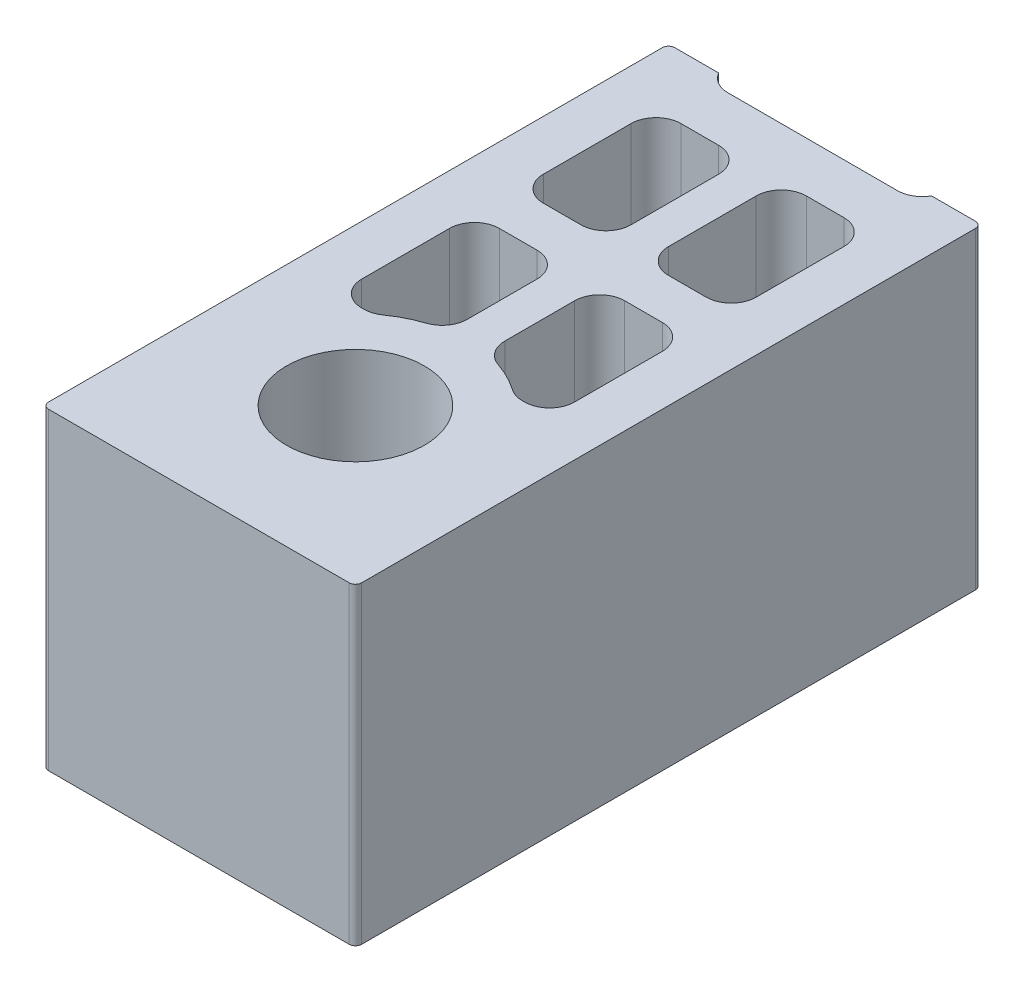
ISO-10303-21;
HEADER;
FILE_DESCRIPTION(('STEP AP214'),'2;1');
FILE_NAME('part.step','',(''),(''),'','','');
FILE_SCHEMA(('AUTOMOTIVE_DESIGN { 1 0 10303 214 1 1 1 1 }'));
ENDSEC;
DATA;
#1=APPLICATION_CONTEXT('core data for automotive mechanical design processes');
#2=APPLICATION_PROTOCOL_DEFINITION('international standard','automotive_design',2000,#1);
#3=PRODUCT_CONTEXT('',#1,'mechanical');
#4=PRODUCT('Part','Part','',(#3));
#5=PRODUCT_RELATED_PRODUCT_CATEGORY('part','',(#4));
#6=PRODUCT_DEFINITION_FORMATION('','',#4);
#7=PRODUCT_DEFINITION_CONTEXT('part definition',#1,'design');
#8=PRODUCT_DEFINITION('design','',#6,#7);
#9=PRODUCT_DEFINITION_SHAPE('','',#8);
#10=(LENGTH_UNIT() NAMED_UNIT(*) SI_UNIT(.MILLI.,.METRE.));
#11=(NAMED_UNIT(*) PLANE_ANGLE_UNIT() SI_UNIT($,.RADIAN.));
#12=(NAMED_UNIT(*) SI_UNIT($,.STERADIAN.) SOLID_ANGLE_UNIT());
#13=UNCERTAINTY_MEASURE_WITH_UNIT(LENGTH_MEASURE(1.E-05),#10,'distance_accuracy_value','');
#14=(GEOMETRIC_REPRESENTATION_CONTEXT(3) GLOBAL_UNCERTAINTY_ASSIGNED_CONTEXT((#13)) GLOBAL_UNIT_ASSIGNED_CONTEXT((#10,
#11,#12)) REPRESENTATION_CONTEXT('',''));
#15=CARTESIAN_POINT('',(0.,0.,0.));
#16=DIRECTION('',(0.,0.,1.));
#17=DIRECTION('',(1.,0.,0.));
#18=AXIS2_PLACEMENT_3D('',#15,#16,#17);
#19=CARTESIAN_POINT('',(0.500000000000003,25.,-50.));
#20=DIRECTION('',(0.,0.,1.));
#21=DIRECTION('',(1.,0.,0.));
#22=AXIS2_PLACEMENT_3D('',#19,#20,#21);
#23=PLANE('',#22);
#24=DIRECTION('',(-1.,0.,0.));
#25=VECTOR('',#24,1.);
#26=CARTESIAN_POINT('',(0.500000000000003,0.,-50.));
#27=LINE('',#26,#25);
#28=CARTESIAN_POINT('',(4.,0.,-50.));
#29=VERTEX_POINT('',#28);
#30=CARTESIAN_POINT('',(0.500000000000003,0.,-50.));
#31=VERTEX_POINT('',#30);
#32=EDGE_CURVE('E596',#29,#31,#27,.T.);
#33=ORIENTED_EDGE('',*,*,#32,.T.);
#34=DIRECTION('',(0.,-1.,0.));
#35=VECTOR('',#34,1.);
#36=CARTESIAN_POINT('',(0.500000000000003,25.,-50.));
#37=LINE('',#36,#35);
#38=CARTESIAN_POINT('',(0.500000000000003,25.,-50.));
#39=VERTEX_POINT('',#38);
#40=EDGE_CURVE('E357',#39,#31,#37,.T.);
#41=ORIENTED_EDGE('',*,*,#40,.F.);
#42=DIRECTION('',(-1.,0.,0.));
#43=VECTOR('',#42,1.);
#44=CARTESIAN_POINT('',(0.500000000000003,25.,-50.));
#45=LINE('',#44,#43);
#46=CARTESIAN_POINT('',(4.,25.,-50.));
#47=VERTEX_POINT('',#46);
#48=EDGE_CURVE('E343',#47,#39,#45,.T.);
#49=ORIENTED_EDGE('',*,*,#48,.F.);
#50=DIRECTION('',(0.,-1.,0.));
#51=VECTOR('',#50,1.);
#52=CARTESIAN_POINT('',(4.,25.,-50.));
#53=LINE('',#52,#51);
#54=EDGE_CURVE('E355',#47,#29,#53,.T.);
#55=ORIENTED_EDGE('',*,*,#54,.T.);
#56=EDGE_LOOP('',(#33,#41,#49,#55));
#57=FACE_BOUND('',#56,.T.);
#58=ADVANCED_FACE('F34',(#57),#23,.F.);
#59=CARTESIAN_POINT('',(0.5,25.,-49.5));
#60=DIRECTION('',(0.,-1.,0.));
#61=DIRECTION('',(0.,0.,-1.));
#62=AXIS2_PLACEMENT_3D('',#59,#60,#61);
#63=CYLINDRICAL_SURFACE('',#62,0.5);
#64=CARTESIAN_POINT('',(0.5,0.,-49.5));
#65=DIRECTION('',(0.,1.,0.));
#66=DIRECTION('',(0.,0.,1.));
#67=AXIS2_PLACEMENT_3D('',#64,#65,#66);
#68=CIRCLE('',#67,0.5);
#69=CARTESIAN_POINT('',(0.,0.,-49.5));
#70=VERTEX_POINT('',#69);
#71=EDGE_CURVE('E625',#31,#70,#68,.T.);
#72=ORIENTED_EDGE('',*,*,#71,.T.);
#73=DIRECTION('',(0.,-1.,0.));
#74=VECTOR('',#73,1.);
#75=CARTESIAN_POINT('',(0.,25.,-49.5));
#76=LINE('',#75,#74);
#77=CARTESIAN_POINT('',(0.,25.,-49.5));
#78=VERTEX_POINT('',#77);
#79=EDGE_CURVE('E369',#78,#70,#76,.T.);
#80=ORIENTED_EDGE('',*,*,#79,.F.);
#81=CARTESIAN_POINT('',(0.5,25.,-49.5));
#82=DIRECTION('',(0.,1.,0.));
#83=DIRECTION('',(0.,0.,1.));
#84=AXIS2_PLACEMENT_3D('',#81,#82,#83);
#85=CIRCLE('',#84,0.5);
#86=EDGE_CURVE('E359',#39,#78,#85,.T.);
#87=ORIENTED_EDGE('',*,*,#86,.F.);
#88=ORIENTED_EDGE('',*,*,#40,.T.);
#89=EDGE_LOOP('',(#72,#80,#87,#88));
#90=FACE_BOUND('',#89,.T.);
#91=ADVANCED_FACE('F686',(#90),#63,.T.);
#92=CARTESIAN_POINT('',(0.,25.,-49.5));
#93=DIRECTION('',(1.,0.,0.));
#94=DIRECTION('',(0.,0.,-1.));
#95=AXIS2_PLACEMENT_3D('',#92,#93,#94);
#96=PLANE('',#95);
#97=DIRECTION('',(0.,0.,1.));
#98=VECTOR('',#97,1.);
#99=CARTESIAN_POINT('',(0.,0.,-49.5));
#100=LINE('',#99,#98);
#101=CARTESIAN_POINT('',(0.,0.,-0.500000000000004));
#102=VERTEX_POINT('',#101);
#103=EDGE_CURVE('E627',#70,#102,#100,.T.);
#104=ORIENTED_EDGE('',*,*,#103,.T.);
#105=DIRECTION('',(0.,-1.,0.));
#106=VECTOR('',#105,1.);
#107=CARTESIAN_POINT('',(0.,25.,-0.500000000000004));
#108=LINE('',#107,#106);
#109=CARTESIAN_POINT('',(0.,25.,-0.500000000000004));
#110=VERTEX_POINT('',#109);
#111=EDGE_CURVE('E661',#110,#102,#108,.T.);
#112=ORIENTED_EDGE('',*,*,#111,.F.);
#113=DIRECTION('',(0.,0.,1.));
#114=VECTOR('',#113,1.);
#115=CARTESIAN_POINT('',(0.,25.,-49.5));
#116=LINE('',#115,#114);
#117=EDGE_CURVE('E608',#78,#110,#116,.T.);
#118=ORIENTED_EDGE('',*,*,#117,.F.);
#119=ORIENTED_EDGE('',*,*,#79,.T.);
#120=EDGE_LOOP('',(#104,#112,#118,#119));
#121=FACE_BOUND('',#120,.T.);
#122=ADVANCED_FACE('F668',(#121),#96,.F.);
#123=CARTESIAN_POINT('',(0.5,25.,-0.5));
#124=DIRECTION('',(0.,-1.,0.));
#125=DIRECTION('',(0.,0.,-1.));
#126=AXIS2_PLACEMENT_3D('',#123,#124,#125);
#127=CYLINDRICAL_SURFACE('',#126,0.5);
#128=CARTESIAN_POINT('',(0.5,0.,-0.5));
#129=DIRECTION('',(0.,1.,0.));
#130=DIRECTION('',(0.,0.,1.));
#131=AXIS2_PLACEMENT_3D('',#128,#129,#130);
#132=CIRCLE('',#131,0.5);
#133=CARTESIAN_POINT('',(0.500000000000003,0.,0.));
#134=VERTEX_POINT('',#133);
#135=EDGE_CURVE('E629',#102,#134,#132,.T.);
#136=ORIENTED_EDGE('',*,*,#135,.T.);
#137=DIRECTION('',(0.,-1.,0.));
#138=VECTOR('',#137,1.);
#139=CARTESIAN_POINT('',(0.500000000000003,25.,0.));
#140=LINE('',#139,#138);
#141=CARTESIAN_POINT('',(0.500000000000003,25.,0.));
#142=VERTEX_POINT('',#141);
#143=EDGE_CURVE('E658',#142,#134,#140,.T.);
#144=ORIENTED_EDGE('',*,*,#143,.F.);
#145=CARTESIAN_POINT('',(0.5,25.,-0.5));
#146=DIRECTION('',(0.,1.,0.));
#147=DIRECTION('',(0.,0.,1.));
#148=AXIS2_PLACEMENT_3D('',#145,#146,#147);
#149=CIRCLE('',#148,0.5);
#150=EDGE_CURVE('E610',#110,#142,#149,.T.);
#151=ORIENTED_EDGE('',*,*,#150,.F.);
#152=ORIENTED_EDGE('',*,*,#111,.T.);
#153=EDGE_LOOP('',(#136,#144,#151,#152));
#154=FACE_BOUND('',#153,.T.);
#155=ADVANCED_FACE('F678',(#154),#127,.T.);
#156=CARTESIAN_POINT('',(0.500000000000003,25.,0.));
#157=DIRECTION('',(0.,0.,-1.));
#158=DIRECTION('',(-1.,0.,0.));
#159=AXIS2_PLACEMENT_3D('',#156,#157,#158);
#160=PLANE('',#159);
#161=DIRECTION('',(1.,0.,0.));
#162=VECTOR('',#161,1.);
#163=CARTESIAN_POINT('',(0.500000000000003,0.,0.));
#164=LINE('',#163,#162);
#165=CARTESIAN_POINT('',(24.5,0.,0.));
#166=VERTEX_POINT('',#165);
#167=EDGE_CURVE('E631',#134,#166,#164,.T.);
#168=ORIENTED_EDGE('',*,*,#167,.T.);
#169=DIRECTION('',(0.,-1.,0.));
#170=VECTOR('',#169,1.);
#171=CARTESIAN_POINT('',(24.5,25.,0.));
#172=LINE('',#171,#170);
#173=CARTESIAN_POINT('',(24.5,25.,0.));
#174=VERTEX_POINT('',#173);
#175=EDGE_CURVE('E655',#174,#166,#172,.T.);
#176=ORIENTED_EDGE('',*,*,#175,.F.);
#177=DIRECTION('',(1.,0.,0.));
#178=VECTOR('',#177,1.);
#179=CARTESIAN_POINT('',(0.500000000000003,25.,0.));
#180=LINE('',#179,#178);
#181=EDGE_CURVE('E612',#142,#174,#180,.T.);
#182=ORIENTED_EDGE('',*,*,#181,.F.);
#183=ORIENTED_EDGE('',*,*,#143,.T.);
#184=EDGE_LOOP('',(#168,#176,#182,#183));
#185=FACE_BOUND('',#184,.T.);
#186=ADVANCED_FACE('F682',(#185),#160,.F.);
#187=CARTESIAN_POINT('',(24.5,25.,-0.5));
#188=DIRECTION('',(0.,-1.,0.));
#189=DIRECTION('',(0.,0.,-1.));
#190=AXIS2_PLACEMENT_3D('',#187,#188,#189);
#191=CYLINDRICAL_SURFACE('',#190,0.5);
#192=CARTESIAN_POINT('',(24.5,0.,-0.5));
#193=DIRECTION('',(0.,1.,0.));
#194=DIRECTION('',(0.,0.,1.));
#195=AXIS2_PLACEMENT_3D('',#192,#193,#194);
#196=CIRCLE('',#195,0.5);
#197=CARTESIAN_POINT('',(25.,0.,-0.500000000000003));
#198=VERTEX_POINT('',#197);
#199=EDGE_CURVE('E633',#166,#198,#196,.T.);
#200=ORIENTED_EDGE('',*,*,#199,.T.);
#201=DIRECTION('',(0.,-1.,0.));
#202=VECTOR('',#201,1.);
#203=CARTESIAN_POINT('',(25.,25.,-0.500000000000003));
#204=LINE('',#203,#202);
#205=CARTESIAN_POINT('',(25.,25.,-0.500000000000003));
#206=VERTEX_POINT('',#205);
#207=EDGE_CURVE('E652',#206,#198,#204,.T.);
#208=ORIENTED_EDGE('',*,*,#207,.F.);
#209=CARTESIAN_POINT('',(24.5,25.,-0.5));
#210=DIRECTION('',(0.,1.,0.));
#211=DIRECTION('',(0.,0.,1.));
#212=AXIS2_PLACEMENT_3D('',#209,#210,#211);
#213=CIRCLE('',#212,0.5);
#214=EDGE_CURVE('E614',#174,#206,#213,.T.);
#215=ORIENTED_EDGE('',*,*,#214,.F.);
#216=ORIENTED_EDGE('',*,*,#175,.T.);
#217=EDGE_LOOP('',(#200,#208,#215,#216));
#218=FACE_BOUND('',#217,.T.);
#219=ADVANCED_FACE('F829',(#218),#191,.T.);
#220=CARTESIAN_POINT('',(25.,25.,-49.5));
#221=DIRECTION('',(-1.,0.,0.));
#222=DIRECTION('',(0.,0.,1.));
#223=AXIS2_PLACEMENT_3D('',#220,#221,#222);
#224=PLANE('',#223);
#225=DIRECTION('',(0.,0.,-1.));
#226=VECTOR('',#225,1.);
#227=CARTESIAN_POINT('',(25.,0.,-49.5));
#228=LINE('',#227,#226);
#229=CARTESIAN_POINT('',(25.,0.,-49.5));
#230=VERTEX_POINT('',#229);
#231=EDGE_CURVE('E635',#198,#230,#228,.T.);
#232=ORIENTED_EDGE('',*,*,#231,.T.);
#233=DIRECTION('',(0.,-1.,0.));
#234=VECTOR('',#233,1.);
#235=CARTESIAN_POINT('',(25.,25.,-49.5));
#236=LINE('',#235,#234);
#237=CARTESIAN_POINT('',(25.,25.,-49.5));
#238=VERTEX_POINT('',#237);
#239=EDGE_CURVE('E649',#238,#230,#236,.T.);
#240=ORIENTED_EDGE('',*,*,#239,.F.);
#241=DIRECTION('',(0.,0.,-1.));
#242=VECTOR('',#241,1.);
#243=CARTESIAN_POINT('',(25.,25.,-49.5));
#244=LINE('',#243,#242);
#245=EDGE_CURVE('E616',#206,#238,#244,.T.);
#246=ORIENTED_EDGE('',*,*,#245,.F.);
#247=ORIENTED_EDGE('',*,*,#207,.T.);
#248=EDGE_LOOP('',(#232,#240,#246,#247));
#249=FACE_BOUND('',#248,.T.);
#250=ADVANCED_FACE('F825',(#249),#224,.F.);
#251=CARTESIAN_POINT('',(24.5,25.,-49.5));
#252=DIRECTION('',(0.,-1.,0.));
#253=DIRECTION('',(0.,0.,-1.));
#254=AXIS2_PLACEMENT_3D('',#251,#252,#253);
#255=CYLINDRICAL_SURFACE('',#254,0.5);
#256=CARTESIAN_POINT('',(24.5,0.,-49.5));
#257=DIRECTION('',(0.,1.,0.));
#258=DIRECTION('',(0.,0.,-1.));
#259=AXIS2_PLACEMENT_3D('',#256,#257,#258);
#260=CIRCLE('',#259,0.5);
#261=CARTESIAN_POINT('',(24.5,0.,-50.));
#262=VERTEX_POINT('',#261);
#263=EDGE_CURVE('E637',#230,#262,#260,.T.);
#264=ORIENTED_EDGE('',*,*,#263,.T.);
#265=DIRECTION('',(0.,-1.,0.));
#266=VECTOR('',#265,1.);
#267=CARTESIAN_POINT('',(24.5,25.,-50.));
#268=LINE('',#267,#266);
#269=CARTESIAN_POINT('',(24.5,25.,-50.));
#270=VERTEX_POINT('',#269);
#271=EDGE_CURVE('E646',#270,#262,#268,.T.);
#272=ORIENTED_EDGE('',*,*,#271,.F.);
#273=CARTESIAN_POINT('',(24.5,25.,-49.5));
#274=DIRECTION('',(0.,1.,0.));
#275=DIRECTION('',(0.,0.,-1.));
#276=AXIS2_PLACEMENT_3D('',#273,#274,#275);
#277=CIRCLE('',#276,0.5);
#278=EDGE_CURVE('E618',#238,#270,#277,.T.);
#279=ORIENTED_EDGE('',*,*,#278,.F.);
#280=ORIENTED_EDGE('',*,*,#239,.T.);
#281=EDGE_LOOP('',(#264,#272,#279,#280));
#282=FACE_BOUND('',#281,.T.);
#283=ADVANCED_FACE('F821',(#282),#255,.T.);
#284=CARTESIAN_POINT('',(21.,25.,-50.));
#285=DIRECTION('',(0.,0.,1.));
#286=DIRECTION('',(1.,0.,0.));
#287=AXIS2_PLACEMENT_3D('',#284,#285,#286);
#288=PLANE('',#287);
#289=DIRECTION('',(-1.,0.,0.));
#290=VECTOR('',#289,1.);
#291=CARTESIAN_POINT('',(21.,0.,-50.));
#292=LINE('',#291,#290);
#293=CARTESIAN_POINT('',(21.,0.,-50.));
#294=VERTEX_POINT('',#293);
#295=EDGE_CURVE('E639',#262,#294,#292,.T.);
#296=ORIENTED_EDGE('',*,*,#295,.T.);
#297=DIRECTION('',(0.,-1.,0.));
#298=VECTOR('',#297,1.);
#299=CARTESIAN_POINT('',(21.,25.,-50.));
#300=LINE('',#299,#298);
#301=CARTESIAN_POINT('',(21.,25.,-50.));
#302=VERTEX_POINT('',#301);
#303=EDGE_CURVE('E623',#302,#294,#300,.T.);
#304=ORIENTED_EDGE('',*,*,#303,.F.);
#305=DIRECTION('',(-1.,0.,0.));
#306=VECTOR('',#305,1.);
#307=CARTESIAN_POINT('',(21.,25.,-50.));
#308=LINE('',#307,#306);
#309=EDGE_CURVE('E620',#270,#302,#308,.T.);
#310=ORIENTED_EDGE('',*,*,#309,.F.);
#311=ORIENTED_EDGE('',*,*,#271,.T.);
#312=EDGE_LOOP('',(#296,#304,#310,#311));
#313=FACE_BOUND('',#312,.T.);
#314=ADVANCED_FACE('F817',(#313),#288,.F.);
#315=CARTESIAN_POINT('',(4.,25.,-49.));
#316=DIRECTION('',(0.,0.,1.));
#317=DIRECTION('',(1.,0.,0.));
#318=AXIS2_PLACEMENT_3D('',#315,#316,#317);
#319=PLANE('',#318);
#320=DIRECTION('',(-1.,0.,0.));
#321=VECTOR('',#320,1.);
#322=CARTESIAN_POINT('',(4.,0.,-49.));
#323=LINE('',#322,#321);
#324=CARTESIAN_POINT('',(19.2679491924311,0.,-49.));
#325=VERTEX_POINT('',#324);
#326=CARTESIAN_POINT('',(5.73205080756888,0.,-49.));
#327=VERTEX_POINT('',#326);
#328=EDGE_CURVE('E360',#325,#327,#323,.T.);
#329=ORIENTED_EDGE('',*,*,#328,.T.);
#330=DIRECTION('',(0.,1.,0.));
#331=VECTOR('',#330,1.);
#332=CARTESIAN_POINT('',(5.73205080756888,25.,-49.));
#333=LINE('',#332,#331);
#334=CARTESIAN_POINT('',(5.73205080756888,25.,-49.));
#335=VERTEX_POINT('',#334);
#336=EDGE_CURVE('E367',#327,#335,#333,.T.);
#337=ORIENTED_EDGE('',*,*,#336,.T.);
#338=DIRECTION('',(-1.,0.,0.));
#339=VECTOR('',#338,1.);
#340=CARTESIAN_POINT('',(4.,25.,-49.));
#341=LINE('',#340,#339);
#342=CARTESIAN_POINT('',(19.2679491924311,25.,-49.));
#343=VERTEX_POINT('',#342);
#344=EDGE_CURVE('E346',#343,#335,#341,.T.);
#345=ORIENTED_EDGE('',*,*,#344,.F.);
#346=DIRECTION('',(0.,-1.,0.));
#347=VECTOR('',#346,1.);
#348=CARTESIAN_POINT('',(19.2679491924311,25.,-49.));
#349=LINE('',#348,#347);
#350=EDGE_CURVE('E364',#343,#325,#349,.T.);
#351=ORIENTED_EDGE('',*,*,#350,.T.);
#352=EDGE_LOOP('',(#329,#337,#345,#351));
#353=FACE_BOUND('',#352,.T.);
#354=ADVANCED_FACE('F809',(#353),#319,.F.);
#355=CARTESIAN_POINT('',(0.5,25.,-49.5));
#356=DIRECTION('',(0.,1.,0.));
#357=DIRECTION('',(0.,0.,1.));
#358=AXIS2_PLACEMENT_3D('',#355,#356,#357);
#359=PLANE('',#358);
#360=DIRECTION('',(0.,0.,-1.));
#361=VECTOR('',#360,1.);
#362=CARTESIAN_POINT('',(14.,25.,-45.));
#363=LINE('',#362,#361);
#364=CARTESIAN_POINT('',(14.,25.,-36.));
#365=VERTEX_POINT('',#364);
#366=CARTESIAN_POINT('',(14.,25.,-43.));
#367=VERTEX_POINT('',#366);
#368=EDGE_CURVE('E1175',#365,#367,#363,.T.);
#369=ORIENTED_EDGE('',*,*,#368,.T.);
#370=CARTESIAN_POINT('',(16.,25.,-43.));
#371=DIRECTION('',(0.,1.,0.));
#372=DIRECTION('',(0.,0.,1.));
#373=AXIS2_PLACEMENT_3D('',#370,#371,#372);
#374=CIRCLE('',#373,2.);
#375=CARTESIAN_POINT('',(16.,25.,-45.));
#376=VERTEX_POINT('',#375);
#377=EDGE_CURVE('E505',#367,#376,#374,.F.);
#378=ORIENTED_EDGE('',*,*,#377,.T.);
#379=DIRECTION('',(1.,0.,0.));
#380=VECTOR('',#379,1.);
#381=CARTESIAN_POINT('',(21.,25.,-45.));
#382=LINE('',#381,#380);
#383=CARTESIAN_POINT('',(19.,25.,-45.));
#384=VERTEX_POINT('',#383);
#385=EDGE_CURVE('E1238',#376,#384,#382,.T.);
#386=ORIENTED_EDGE('',*,*,#385,.T.);
#387=CARTESIAN_POINT('',(19.,25.,-43.));
#388=DIRECTION('',(0.,1.,0.));
#389=DIRECTION('',(0.,0.,1.));
#390=AXIS2_PLACEMENT_3D('',#387,#388,#389);
#391=CIRCLE('',#390,2.);
#392=CARTESIAN_POINT('',(21.,25.,-43.));
#393=VERTEX_POINT('',#392);
#394=EDGE_CURVE('E497',#384,#393,#391,.F.);
#395=ORIENTED_EDGE('',*,*,#394,.T.);
#396=DIRECTION('',(0.,0.,1.));
#397=VECTOR('',#396,1.);
#398=CARTESIAN_POINT('',(21.,25.,-45.));
#399=LINE('',#398,#397);
#400=CARTESIAN_POINT('',(21.,25.,-36.));
#401=VERTEX_POINT('',#400);
#402=EDGE_CURVE('E1249',#393,#401,#399,.T.);
#403=ORIENTED_EDGE('',*,*,#402,.T.);
#404=CARTESIAN_POINT('',(19.,25.,-36.));
#405=DIRECTION('',(0.,1.,0.));
#406=DIRECTION('',(0.,0.,1.));
#407=AXIS2_PLACEMENT_3D('',#404,#405,#406);
#408=CIRCLE('',#407,2.);
#409=CARTESIAN_POINT('',(19.,25.,-34.));
#410=VERTEX_POINT('',#409);
#411=EDGE_CURVE('E469',#401,#410,#408,.F.);
#412=ORIENTED_EDGE('',*,*,#411,.T.);
#413=DIRECTION('',(-1.,0.,0.));
#414=VECTOR('',#413,1.);
#415=CARTESIAN_POINT('',(21.,25.,-34.));
#416=LINE('',#415,#414);
#417=CARTESIAN_POINT('',(16.,25.,-34.));
#418=VERTEX_POINT('',#417);
#419=EDGE_CURVE('E1180',#410,#418,#416,.T.);
#420=ORIENTED_EDGE('',*,*,#419,.T.);
#421=CARTESIAN_POINT('',(16.,25.,-36.));
#422=DIRECTION('',(0.,1.,0.));
#423=DIRECTION('',(0.,0.,1.));
#424=AXIS2_PLACEMENT_3D('',#421,#422,#423);
#425=CIRCLE('',#424,2.);
#426=EDGE_CURVE('E528',#418,#365,#425,.F.);
#427=ORIENTED_EDGE('',*,*,#426,.T.);
#428=EDGE_LOOP('',(#369,#378,#386,#395,#403,#412,#420,#427));
#429=FACE_BOUND('',#428,.T.);
#430=CARTESIAN_POINT('',(12.5,25.,-12.5));
#431=DIRECTION('',(0.,-1.,0.));
#432=DIRECTION('',(0.,0.,-1.));
#433=AXIS2_PLACEMENT_3D('',#430,#431,#432);
#434=CIRCLE('',#433,5.5);
#435=CARTESIAN_POINT('',(12.5,25.,-18.));
#436=VERTEX_POINT('',#435);
#437=EDGE_CURVE('E1171',#436,#436,#434,.T.);
#438=ORIENTED_EDGE('',*,*,#437,.T.);
#439=EDGE_LOOP('',(#438));
#440=FACE_BOUND('',#439,.T.);
#441=DIRECTION('',(1.,0.,0.));
#442=VECTOR('',#441,1.);
#443=CARTESIAN_POINT('',(21.,25.,-30.5));
#444=LINE('',#443,#442);
#445=CARTESIAN_POINT('',(16.,25.,-30.5));
#446=VERTEX_POINT('',#445);
#447=CARTESIAN_POINT('',(19.,25.,-30.5));
#448=VERTEX_POINT('',#447);
#449=EDGE_CURVE('E575',#446,#448,#444,.T.);
#450=ORIENTED_EDGE('',*,*,#449,.T.);
#451=CARTESIAN_POINT('',(19.,25.,-28.5));
#452=DIRECTION('',(0.,1.,0.));
#453=DIRECTION('',(0.,0.,1.));
#454=AXIS2_PLACEMENT_3D('',#451,#452,#453);
#455=CIRCLE('',#454,2.);
#456=CARTESIAN_POINT('',(21.,25.,-28.5));
#457=VERTEX_POINT('',#456);
#458=EDGE_CURVE('E485',#448,#457,#455,.F.);
#459=ORIENTED_EDGE('',*,*,#458,.T.);
#460=DIRECTION('',(0.,0.,1.));
#461=VECTOR('',#460,1.);
#462=CARTESIAN_POINT('',(21.,25.,-30.5));
#463=LINE('',#462,#461);
#464=CARTESIAN_POINT('',(21.,25.,-21.5));
#465=VERTEX_POINT('',#464);
#466=EDGE_CURVE('E1184',#457,#465,#463,.T.);
#467=ORIENTED_EDGE('',*,*,#466,.T.);
#468=CARTESIAN_POINT('',(19.,25.,-21.5));
#469=DIRECTION('',(0.,1.,0.));
#470=DIRECTION('',(0.,0.,1.));
#471=AXIS2_PLACEMENT_3D('',#468,#469,#470);
#472=CIRCLE('',#471,2.);
#473=CARTESIAN_POINT('',(19.,25.,-19.5));
#474=VERTEX_POINT('',#473);
#475=EDGE_CURVE('E481',#465,#474,#472,.F.);
#476=ORIENTED_EDGE('',*,*,#475,.T.);
#477=DIRECTION('',(-1.,0.,0.));
#478=VECTOR('',#477,1.);
#479=CARTESIAN_POINT('',(21.,25.,-19.5));
#480=LINE('',#479,#478);
#481=CARTESIAN_POINT('',(18.8245553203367,25.,-19.5));
#482=VERTEX_POINT('',#481);
#483=EDGE_CURVE('E1187',#474,#482,#480,.T.);
#484=ORIENTED_EDGE('',*,*,#483,.T.);
#485=CARTESIAN_POINT('',(18.8245553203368,25.,-21.5));
#486=DIRECTION('',(0.,1.,0.));
#487=DIRECTION('',(0.,0.,1.));
#488=AXIS2_PLACEMENT_3D('',#485,#486,#487);
#489=CIRCLE('',#488,2.);
#490=CARTESIAN_POINT('',(17.6746361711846,25.,-19.8636363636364));
#491=VERTEX_POINT('',#490);
#492=EDGE_CURVE('E517',#482,#491,#489,.F.);
#493=ORIENTED_EDGE('',*,*,#492,.T.);
#494=CARTESIAN_POINT('',(12.5,25.,-12.5));
#495=DIRECTION('',(0.,1.,0.));
#496=DIRECTION('',(0.,0.,-1.));
#497=AXIS2_PLACEMENT_3D('',#494,#495,#496);
#498=CIRCLE('',#497,9.);
#499=CARTESIAN_POINT('',(15.3636363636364,25.,-21.0322673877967));
#500=VERTEX_POINT('',#499);
#501=EDGE_CURVE('E1190',#491,#500,#498,.T.);
#502=ORIENTED_EDGE('',*,*,#501,.T.);
#503=CARTESIAN_POINT('',(16.,25.,-22.9283268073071));
#504=DIRECTION('',(0.,1.,0.));
#505=DIRECTION('',(0.,0.,1.));
#506=AXIS2_PLACEMENT_3D('',#503,#504,#505);
#507=CIRCLE('',#506,2.);
#508=CARTESIAN_POINT('',(14.,25.,-22.9283268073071));
#509=VERTEX_POINT('',#508);
#510=EDGE_CURVE('E524',#500,#509,#507,.F.);
#511=ORIENTED_EDGE('',*,*,#510,.T.);
#512=DIRECTION('',(0.,0.,-1.));
#513=VECTOR('',#512,1.);
#514=CARTESIAN_POINT('',(14.,25.,-21.3741196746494));
#515=LINE('',#514,#513);
#516=CARTESIAN_POINT('',(14.,25.,-28.5));
#517=VERTEX_POINT('',#516);
#518=EDGE_CURVE('E1193',#509,#517,#515,.T.);
#519=ORIENTED_EDGE('',*,*,#518,.T.);
#520=CARTESIAN_POINT('',(16.,25.,-28.5));
#521=DIRECTION('',(0.,1.,0.));
#522=DIRECTION('',(0.,0.,1.));
#523=AXIS2_PLACEMENT_3D('',#520,#521,#522);
#524=CIRCLE('',#523,2.);
#525=EDGE_CURVE('E501',#517,#446,#524,.F.);
#526=ORIENTED_EDGE('',*,*,#525,.T.);
#527=EDGE_LOOP('',(#450,#459,#467,#476,#484,#493,#502,#511,#519,#526));
#528=FACE_BOUND('',#527,.T.);
#529=DIRECTION('',(-1.,0.,0.));
#530=VECTOR('',#529,1.);
#531=CARTESIAN_POINT('',(4.,25.,-19.5));
#532=LINE('',#531,#530);
#533=CARTESIAN_POINT('',(6.17544467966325,25.,-19.5));
#534=VERTEX_POINT('',#533);
#535=CARTESIAN_POINT('',(6.,25.,-19.5));
#536=VERTEX_POINT('',#535);
#537=EDGE_CURVE('E554',#534,#536,#532,.T.);
#538=ORIENTED_EDGE('',*,*,#537,.T.);
#539=CARTESIAN_POINT('',(6.,25.,-21.5));
#540=DIRECTION('',(0.,1.,0.));
#541=DIRECTION('',(0.,0.,1.));
#542=AXIS2_PLACEMENT_3D('',#539,#540,#541);
#543=CIRCLE('',#542,2.);
#544=CARTESIAN_POINT('',(4.,25.,-21.5));
#545=VERTEX_POINT('',#544);
#546=EDGE_CURVE('E11',#536,#545,#543,.F.);
#547=ORIENTED_EDGE('',*,*,#546,.T.);
#548=DIRECTION('',(0.,0.,-1.));
#549=VECTOR('',#548,1.);
#550=CARTESIAN_POINT('',(4.,25.,-30.5));
#551=LINE('',#550,#549);
#552=CARTESIAN_POINT('',(4.,25.,-28.5));
#553=VERTEX_POINT('',#552);
#554=EDGE_CURVE('E546',#545,#553,#551,.T.);
#555=ORIENTED_EDGE('',*,*,#554,.T.);
#556=CARTESIAN_POINT('',(6.,25.,-28.5));
#557=DIRECTION('',(0.,1.,0.));
#558=DIRECTION('',(0.,0.,1.));
#559=AXIS2_PLACEMENT_3D('',#556,#557,#558);
#560=CIRCLE('',#559,2.);
#561=CARTESIAN_POINT('',(6.,25.,-30.5));
#562=VERTEX_POINT('',#561);
#563=EDGE_CURVE('E513',#553,#562,#560,.F.);
#564=ORIENTED_EDGE('',*,*,#563,.T.);
#565=DIRECTION('',(1.,0.,0.));
#566=VECTOR('',#565,1.);
#567=CARTESIAN_POINT('',(4.,25.,-30.5));
#568=LINE('',#567,#566);
#569=CARTESIAN_POINT('',(9.,25.,-30.5));
#570=VERTEX_POINT('',#569);
#571=EDGE_CURVE('E558',#562,#570,#568,.T.);
#572=ORIENTED_EDGE('',*,*,#571,.T.);
#573=CARTESIAN_POINT('',(9.,25.,-28.5));
#574=DIRECTION('',(0.,1.,0.));
#575=DIRECTION('',(0.,0.,1.));
#576=AXIS2_PLACEMENT_3D('',#573,#574,#575);
#577=CIRCLE('',#576,2.);
#578=CARTESIAN_POINT('',(11.,25.,-28.5));
#579=VERTEX_POINT('',#578);
#580=EDGE_CURVE('E489',#570,#579,#577,.F.);
#581=ORIENTED_EDGE('',*,*,#580,.T.);
#582=DIRECTION('',(0.,0.,1.));
#583=VECTOR('',#582,1.);
#584=CARTESIAN_POINT('',(11.,25.,-21.3741196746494));
#585=LINE('',#584,#583);
#586=CARTESIAN_POINT('',(11.,25.,-22.9283268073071));
#587=VERTEX_POINT('',#586);
#588=EDGE_CURVE('E561',#579,#587,#585,.T.);
#589=ORIENTED_EDGE('',*,*,#588,.T.);
#590=CARTESIAN_POINT('',(9.,25.,-22.9283268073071));
#591=DIRECTION('',(0.,1.,0.));
#592=DIRECTION('',(0.,0.,1.));
#593=AXIS2_PLACEMENT_3D('',#590,#591,#592);
#594=CIRCLE('',#593,2.);
#595=CARTESIAN_POINT('',(9.63636363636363,25.,-21.0322673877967));
#596=VERTEX_POINT('',#595);
#597=EDGE_CURVE('E477',#587,#596,#594,.F.);
#598=ORIENTED_EDGE('',*,*,#597,.T.);
#599=CARTESIAN_POINT('',(12.5,25.,-12.5));
#600=DIRECTION('',(0.,1.,0.));
#601=DIRECTION('',(0.,0.,-1.));
#602=AXIS2_PLACEMENT_3D('',#599,#600,#601);
#603=CIRCLE('',#602,9.);
#604=CARTESIAN_POINT('',(7.32536382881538,25.,-19.8636363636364));
#605=VERTEX_POINT('',#604);
#606=EDGE_CURVE('E569',#596,#605,#603,.T.);
#607=ORIENTED_EDGE('',*,*,#606,.T.);
#608=CARTESIAN_POINT('',(6.17544467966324,25.,-21.5));
#609=DIRECTION('',(0.,1.,0.));
#610=DIRECTION('',(0.,0.,1.));
#611=AXIS2_PLACEMENT_3D('',#608,#609,#610);
#612=CIRCLE('',#611,2.);
#613=EDGE_CURVE('E56',#605,#534,#612,.F.);
#614=ORIENTED_EDGE('',*,*,#613,.T.);
#615=EDGE_LOOP('',(#538,#547,#555,#564,#572,#581,#589,#598,#607,#614));
#616=FACE_BOUND('',#615,.T.);
#617=DIRECTION('',(-1.,0.,0.));
#618=VECTOR('',#617,1.);
#619=CARTESIAN_POINT('',(4.,25.,-34.));
#620=LINE('',#619,#618);
#621=CARTESIAN_POINT('',(9.,25.,-34.));
#622=VERTEX_POINT('',#621);
#623=CARTESIAN_POINT('',(6.,25.,-34.));
#624=VERTEX_POINT('',#623);
#625=EDGE_CURVE('E593',#622,#624,#620,.T.);
#626=ORIENTED_EDGE('',*,*,#625,.T.);
#627=CARTESIAN_POINT('',(6.,25.,-36.));
#628=DIRECTION('',(0.,1.,0.));
#629=DIRECTION('',(0.,0.,1.));
#630=AXIS2_PLACEMENT_3D('',#627,#628,#629);
#631=CIRCLE('',#630,2.);
#632=CARTESIAN_POINT('',(4.,25.,-36.));
#633=VERTEX_POINT('',#632);
#634=EDGE_CURVE('E532',#624,#633,#631,.F.);
#635=ORIENTED_EDGE('',*,*,#634,.T.);
#636=DIRECTION('',(0.,0.,-1.));
#637=VECTOR('',#636,1.);
#638=CARTESIAN_POINT('',(4.,25.,-45.));
#639=LINE('',#638,#637);
#640=CARTESIAN_POINT('',(4.,25.,-43.));
#641=VERTEX_POINT('',#640);
#642=EDGE_CURVE('E583',#633,#641,#639,.T.);
#643=ORIENTED_EDGE('',*,*,#642,.T.);
#644=CARTESIAN_POINT('',(6.,25.,-43.));
#645=DIRECTION('',(0.,1.,0.));
#646=DIRECTION('',(0.,0.,1.));
#647=AXIS2_PLACEMENT_3D('',#644,#645,#646);
#648=CIRCLE('',#647,2.);
#649=CARTESIAN_POINT('',(6.,25.,-45.));
#650=VERTEX_POINT('',#649);
#651=EDGE_CURVE('E509',#641,#650,#648,.F.);
#652=ORIENTED_EDGE('',*,*,#651,.T.);
#653=DIRECTION('',(1.,0.,0.));
#654=VECTOR('',#653,1.);
#655=CARTESIAN_POINT('',(4.,25.,-45.));
#656=LINE('',#655,#654);
#657=CARTESIAN_POINT('',(9.,25.,-45.));
#658=VERTEX_POINT('',#657);
#659=EDGE_CURVE('E586',#650,#658,#656,.T.);
#660=ORIENTED_EDGE('',*,*,#659,.T.);
#661=CARTESIAN_POINT('',(9.,25.,-43.));
#662=DIRECTION('',(0.,1.,0.));
#663=DIRECTION('',(0.,0.,1.));
#664=AXIS2_PLACEMENT_3D('',#661,#662,#663);
#665=CIRCLE('',#664,2.);
#666=CARTESIAN_POINT('',(11.,25.,-43.));
#667=VERTEX_POINT('',#666);
#668=EDGE_CURVE('E493',#658,#667,#665,.F.);
#669=ORIENTED_EDGE('',*,*,#668,.T.);
#670=DIRECTION('',(0.,0.,1.));
#671=VECTOR('',#670,1.);
#672=CARTESIAN_POINT('',(11.,25.,-45.));
#673=LINE('',#672,#671);
#674=CARTESIAN_POINT('',(11.,25.,-36.));
#675=VERTEX_POINT('',#674);
#676=EDGE_CURVE('E590',#667,#675,#673,.T.);
#677=ORIENTED_EDGE('',*,*,#676,.T.);
#678=CARTESIAN_POINT('',(9.,25.,-36.));
#679=DIRECTION('',(0.,1.,0.));
#680=DIRECTION('',(0.,0.,1.));
#681=AXIS2_PLACEMENT_3D('',#678,#679,#680);
#682=CIRCLE('',#681,2.);
#683=EDGE_CURVE('E473',#675,#622,#682,.F.);
#684=ORIENTED_EDGE('',*,*,#683,.T.);
#685=EDGE_LOOP('',(#626,#635,#643,#652,#660,#669,#677,#684));
#686=FACE_BOUND('',#685,.T.);
#687=ORIENTED_EDGE('',*,*,#344,.T.);
#688=CARTESIAN_POINT('',(5.73205080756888,25.,-51.));
#689=DIRECTION('',(0.,1.,0.));
#690=DIRECTION('',(0.,0.,1.));
#691=AXIS2_PLACEMENT_3D('',#688,#689,#690);
#692=CIRCLE('',#691,2.);
#693=EDGE_CURVE('E340',#335,#47,#692,.F.);
#694=ORIENTED_EDGE('',*,*,#693,.T.);
#695=ORIENTED_EDGE('',*,*,#48,.T.);
#696=ORIENTED_EDGE('',*,*,#86,.T.);
#697=ORIENTED_EDGE('',*,*,#117,.T.);
#698=ORIENTED_EDGE('',*,*,#150,.T.);
#699=ORIENTED_EDGE('',*,*,#181,.T.);
#700=ORIENTED_EDGE('',*,*,#214,.T.);
#701=ORIENTED_EDGE('',*,*,#245,.T.);
#702=ORIENTED_EDGE('',*,*,#278,.T.);
#703=ORIENTED_EDGE('',*,*,#309,.T.);
#704=CARTESIAN_POINT('',(19.2679491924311,25.,-51.));
#705=DIRECTION('',(0.,1.,0.));
#706=DIRECTION('',(0.,0.,1.));
#707=AXIS2_PLACEMENT_3D('',#704,#705,#706);
#708=CIRCLE('',#707,2.);
#709=EDGE_CURVE('E465',#302,#343,#708,.F.);
#710=ORIENTED_EDGE('',*,*,#709,.T.);
#711=EDGE_LOOP('',(#687,#694,#695,#696,#697,#698,#699,#700,#701,#702,#703,#710));
#712=FACE_BOUND('',#711,.T.);
#713=ADVANCED_FACE('F342',(#429,#440,#528,#616,#686,#712),#359,.T.);
#714=CARTESIAN_POINT('',(0.5,0.,-49.5));
#715=DIRECTION('',(0.,1.,0.));
#716=DIRECTION('',(0.,0.,1.));
#717=AXIS2_PLACEMENT_3D('',#714,#715,#716);
#718=PLANE('',#717);
#719=DIRECTION('',(0.,0.,1.));
#720=VECTOR('',#719,1.);
#721=CARTESIAN_POINT('',(21.,0.,-45.));
#722=LINE('',#721,#720);
#723=CARTESIAN_POINT('',(21.,0.,-43.));
#724=VERTEX_POINT('',#723);
#725=CARTESIAN_POINT('',(21.,0.,-36.));
#726=VERTEX_POINT('',#725);
#727=EDGE_CURVE('E1242',#724,#726,#722,.T.);
#728=ORIENTED_EDGE('',*,*,#727,.F.);
#729=CARTESIAN_POINT('',(19.,0.,-43.));
#730=DIRECTION('',(0.,1.,0.));
#731=DIRECTION('',(0.,0.,1.));
#732=AXIS2_PLACEMENT_3D('',#729,#730,#731);
#733=CIRCLE('',#732,2.);
#734=CARTESIAN_POINT('',(19.,0.,-45.));
#735=VERTEX_POINT('',#734);
#736=EDGE_CURVE('E495',#724,#735,#733,.T.);
#737=ORIENTED_EDGE('',*,*,#736,.T.);
#738=DIRECTION('',(1.,0.,0.));
#739=VECTOR('',#738,1.);
#740=CARTESIAN_POINT('',(21.,0.,-45.));
#741=LINE('',#740,#739);
#742=CARTESIAN_POINT('',(16.,0.,-45.));
#743=VERTEX_POINT('',#742);
#744=EDGE_CURVE('E1244',#743,#735,#741,.T.);
#745=ORIENTED_EDGE('',*,*,#744,.F.);
#746=CARTESIAN_POINT('',(16.,0.,-43.));
#747=DIRECTION('',(0.,1.,0.));
#748=DIRECTION('',(0.,0.,1.));
#749=AXIS2_PLACEMENT_3D('',#746,#747,#748);
#750=CIRCLE('',#749,2.);
#751=CARTESIAN_POINT('',(14.,0.,-43.));
#752=VERTEX_POINT('',#751);
#753=EDGE_CURVE('E503',#743,#752,#750,.T.);
#754=ORIENTED_EDGE('',*,*,#753,.T.);
#755=DIRECTION('',(0.,0.,-1.));
#756=VECTOR('',#755,1.);
#757=CARTESIAN_POINT('',(14.,0.,-45.));
#758=LINE('',#757,#756);
#759=CARTESIAN_POINT('',(14.,0.,-36.));
#760=VERTEX_POINT('',#759);
#761=EDGE_CURVE('E1235',#760,#752,#758,.T.);
#762=ORIENTED_EDGE('',*,*,#761,.F.);
#763=CARTESIAN_POINT('',(16.,0.,-36.));
#764=DIRECTION('',(0.,1.,0.));
#765=DIRECTION('',(0.,0.,1.));
#766=AXIS2_PLACEMENT_3D('',#763,#764,#765);
#767=CIRCLE('',#766,2.);
#768=CARTESIAN_POINT('',(16.,0.,-34.));
#769=VERTEX_POINT('',#768);
#770=EDGE_CURVE('E526',#760,#769,#767,.T.);
#771=ORIENTED_EDGE('',*,*,#770,.T.);
#772=DIRECTION('',(-1.,0.,0.));
#773=VECTOR('',#772,1.);
#774=CARTESIAN_POINT('',(21.,0.,-34.));
#775=LINE('',#774,#773);
#776=CARTESIAN_POINT('',(19.,0.,-34.));
#777=VERTEX_POINT('',#776);
#778=EDGE_CURVE('E1239',#777,#769,#775,.T.);
#779=ORIENTED_EDGE('',*,*,#778,.F.);
#780=CARTESIAN_POINT('',(19.,0.,-36.));
#781=DIRECTION('',(0.,1.,0.));
#782=DIRECTION('',(0.,0.,1.));
#783=AXIS2_PLACEMENT_3D('',#780,#781,#782);
#784=CIRCLE('',#783,2.);
#785=EDGE_CURVE('E467',#777,#726,#784,.T.);
#786=ORIENTED_EDGE('',*,*,#785,.T.);
#787=EDGE_LOOP('',(#728,#737,#745,#754,#762,#771,#779,#786));
#788=FACE_BOUND('',#787,.T.);
#789=CARTESIAN_POINT('',(12.5,0.,-12.5));
#790=DIRECTION('',(0.,-1.,0.));
#791=DIRECTION('',(0.,0.,-1.));
#792=AXIS2_PLACEMENT_3D('',#789,#790,#791);
#793=CIRCLE('',#792,5.5);
#794=CARTESIAN_POINT('',(12.5,0.,-18.));
#795=VERTEX_POINT('',#794);
#796=EDGE_CURVE('E1174',#795,#795,#793,.T.);
#797=ORIENTED_EDGE('',*,*,#796,.F.);
#798=EDGE_LOOP('',(#797));
#799=FACE_BOUND('',#798,.T.);
#800=DIRECTION('',(-1.,0.,0.));
#801=VECTOR('',#800,1.);
#802=CARTESIAN_POINT('',(21.,0.,-19.5));
#803=LINE('',#802,#801);
#804=CARTESIAN_POINT('',(19.,0.,-19.5));
#805=VERTEX_POINT('',#804);
#806=CARTESIAN_POINT('',(18.8245553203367,0.,-19.5));
#807=VERTEX_POINT('',#806);
#808=EDGE_CURVE('E1200',#805,#807,#803,.T.);
#809=ORIENTED_EDGE('',*,*,#808,.F.);
#810=CARTESIAN_POINT('',(19.,0.,-21.5));
#811=DIRECTION('',(0.,1.,0.));
#812=DIRECTION('',(0.,0.,1.));
#813=AXIS2_PLACEMENT_3D('',#810,#811,#812);
#814=CIRCLE('',#813,2.);
#815=CARTESIAN_POINT('',(21.,0.,-21.5));
#816=VERTEX_POINT('',#815);
#817=EDGE_CURVE('E479',#805,#816,#814,.T.);
#818=ORIENTED_EDGE('',*,*,#817,.T.);
#819=DIRECTION('',(0.,0.,1.));
#820=VECTOR('',#819,1.);
#821=CARTESIAN_POINT('',(21.,0.,-30.5));
#822=LINE('',#821,#820);
#823=CARTESIAN_POINT('',(21.,0.,-28.5));
#824=VERTEX_POINT('',#823);
#825=EDGE_CURVE('E1177',#824,#816,#822,.T.);
#826=ORIENTED_EDGE('',*,*,#825,.F.);
#827=CARTESIAN_POINT('',(19.,0.,-28.5));
#828=DIRECTION('',(0.,1.,0.));
#829=DIRECTION('',(0.,0.,1.));
#830=AXIS2_PLACEMENT_3D('',#827,#828,#829);
#831=CIRCLE('',#830,2.);
#832=CARTESIAN_POINT('',(19.,0.,-30.5));
#833=VERTEX_POINT('',#832);
#834=EDGE_CURVE('E483',#824,#833,#831,.T.);
#835=ORIENTED_EDGE('',*,*,#834,.T.);
#836=DIRECTION('',(1.,0.,0.));
#837=VECTOR('',#836,1.);
#838=CARTESIAN_POINT('',(21.,0.,-30.5));
#839=LINE('',#838,#837);
#840=CARTESIAN_POINT('',(16.,0.,-30.5));
#841=VERTEX_POINT('',#840);
#842=EDGE_CURVE('E564',#841,#833,#839,.T.);
#843=ORIENTED_EDGE('',*,*,#842,.F.);
#844=CARTESIAN_POINT('',(16.,0.,-28.5));
#845=DIRECTION('',(0.,1.,0.));
#846=DIRECTION('',(0.,0.,1.));
#847=AXIS2_PLACEMENT_3D('',#844,#845,#846);
#848=CIRCLE('',#847,2.);
#849=CARTESIAN_POINT('',(14.,0.,-28.5));
#850=VERTEX_POINT('',#849);
#851=EDGE_CURVE('E499',#841,#850,#848,.T.);
#852=ORIENTED_EDGE('',*,*,#851,.T.);
#853=DIRECTION('',(0.,0.,-1.));
#854=VECTOR('',#853,1.);
#855=CARTESIAN_POINT('',(14.,0.,-21.3741196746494));
#856=LINE('',#855,#854);
#857=CARTESIAN_POINT('',(14.,0.,-22.9283268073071));
#858=VERTEX_POINT('',#857);
#859=EDGE_CURVE('E1205',#858,#850,#856,.T.);
#860=ORIENTED_EDGE('',*,*,#859,.F.);
#861=CARTESIAN_POINT('',(16.,0.,-22.9283268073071));
#862=DIRECTION('',(0.,1.,0.));
#863=DIRECTION('',(0.,0.,1.));
#864=AXIS2_PLACEMENT_3D('',#861,#862,#863);
#865=CIRCLE('',#864,2.);
#866=CARTESIAN_POINT('',(15.3636363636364,0.,-21.0322673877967));
#867=VERTEX_POINT('',#866);
#868=EDGE_CURVE('E522',#858,#867,#865,.T.);
#869=ORIENTED_EDGE('',*,*,#868,.T.);
#870=CARTESIAN_POINT('',(12.5,0.,-12.5));
#871=DIRECTION('',(0.,1.,0.));
#872=DIRECTION('',(0.,0.,-1.));
#873=AXIS2_PLACEMENT_3D('',#870,#871,#872);
#874=CIRCLE('',#873,9.);
#875=CARTESIAN_POINT('',(17.6746361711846,0.,-19.8636363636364));
#876=VERTEX_POINT('',#875);
#877=EDGE_CURVE('E1203',#876,#867,#874,.T.);
#878=ORIENTED_EDGE('',*,*,#877,.F.);
#879=CARTESIAN_POINT('',(18.8245553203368,0.,-21.5));
#880=DIRECTION('',(0.,1.,0.));
#881=DIRECTION('',(0.,0.,1.));
#882=AXIS2_PLACEMENT_3D('',#879,#880,#881);
#883=CIRCLE('',#882,2.);
#884=EDGE_CURVE('E515',#876,#807,#883,.T.);
#885=ORIENTED_EDGE('',*,*,#884,.T.);
#886=EDGE_LOOP('',(#809,#818,#826,#835,#843,#852,#860,#869,#878,#885));
#887=FACE_BOUND('',#886,.T.);
#888=DIRECTION('',(1.,0.,0.));
#889=VECTOR('',#888,1.);
#890=CARTESIAN_POINT('',(4.,0.,-30.5));
#891=LINE('',#890,#889);
#892=CARTESIAN_POINT('',(6.,0.,-30.5));
#893=VERTEX_POINT('',#892);
#894=CARTESIAN_POINT('',(9.,0.,-30.5));
#895=VERTEX_POINT('',#894);
#896=EDGE_CURVE('E574',#893,#895,#891,.T.);
#897=ORIENTED_EDGE('',*,*,#896,.F.);
#898=CARTESIAN_POINT('',(6.,0.,-28.5));
#899=DIRECTION('',(0.,1.,0.));
#900=DIRECTION('',(0.,0.,1.));
#901=AXIS2_PLACEMENT_3D('',#898,#899,#900);
#902=CIRCLE('',#901,2.);
#903=CARTESIAN_POINT('',(4.,0.,-28.5));
#904=VERTEX_POINT('',#903);
#905=EDGE_CURVE('E511',#893,#904,#902,.T.);
#906=ORIENTED_EDGE('',*,*,#905,.T.);
#907=DIRECTION('',(0.,0.,-1.));
#908=VECTOR('',#907,1.);
#909=CARTESIAN_POINT('',(4.,0.,-30.5));
#910=LINE('',#909,#908);
#911=CARTESIAN_POINT('',(4.,0.,-21.5));
#912=VERTEX_POINT('',#911);
#913=EDGE_CURVE('E541',#912,#904,#910,.T.);
#914=ORIENTED_EDGE('',*,*,#913,.F.);
#915=CARTESIAN_POINT('',(6.,0.,-21.5));
#916=DIRECTION('',(0.,1.,0.));
#917=DIRECTION('',(0.,0.,1.));
#918=AXIS2_PLACEMENT_3D('',#915,#916,#917);
#919=CIRCLE('',#918,2.);
#920=CARTESIAN_POINT('',(6.,0.,-19.5));
#921=VERTEX_POINT('',#920);
#922=EDGE_CURVE('E42',#912,#921,#919,.T.);
#923=ORIENTED_EDGE('',*,*,#922,.T.);
#924=DIRECTION('',(-1.,0.,0.));
#925=VECTOR('',#924,1.);
#926=CARTESIAN_POINT('',(4.,0.,-19.5));
#927=LINE('',#926,#925);
#928=CARTESIAN_POINT('',(6.17544467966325,0.,-19.5));
#929=VERTEX_POINT('',#928);
#930=EDGE_CURVE('E539',#929,#921,#927,.T.);
#931=ORIENTED_EDGE('',*,*,#930,.F.);
#932=CARTESIAN_POINT('',(6.17544467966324,0.,-21.5));
#933=DIRECTION('',(0.,1.,0.));
#934=DIRECTION('',(0.,0.,1.));
#935=AXIS2_PLACEMENT_3D('',#932,#933,#934);
#936=CIRCLE('',#935,2.);
#937=CARTESIAN_POINT('',(7.32536382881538,0.,-19.8636363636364));
#938=VERTEX_POINT('',#937);
#939=EDGE_CURVE('E519',#929,#938,#936,.T.);
#940=ORIENTED_EDGE('',*,*,#939,.T.);
#941=CARTESIAN_POINT('',(12.5,0.,-12.5));
#942=DIRECTION('',(0.,1.,0.));
#943=DIRECTION('',(0.,0.,-1.));
#944=AXIS2_PLACEMENT_3D('',#941,#942,#943);
#945=CIRCLE('',#944,9.);
#946=CARTESIAN_POINT('',(9.63636363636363,0.,-21.0322673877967));
#947=VERTEX_POINT('',#946);
#948=EDGE_CURVE('E547',#947,#938,#945,.T.);
#949=ORIENTED_EDGE('',*,*,#948,.F.);
#950=CARTESIAN_POINT('',(9.,0.,-22.9283268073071));
#951=DIRECTION('',(0.,1.,0.));
#952=DIRECTION('',(0.,0.,1.));
#953=AXIS2_PLACEMENT_3D('',#950,#951,#952);
#954=CIRCLE('',#953,2.);
#955=CARTESIAN_POINT('',(11.,0.,-22.9283268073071));
#956=VERTEX_POINT('',#955);
#957=EDGE_CURVE('E475',#947,#956,#954,.T.);
#958=ORIENTED_EDGE('',*,*,#957,.T.);
#959=DIRECTION('',(0.,0.,1.));
#960=VECTOR('',#959,1.);
#961=CARTESIAN_POINT('',(11.,0.,-21.3741196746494));
#962=LINE('',#961,#960);
#963=CARTESIAN_POINT('',(11.,0.,-28.5));
#964=VERTEX_POINT('',#963);
#965=EDGE_CURVE('E578',#964,#956,#962,.T.);
#966=ORIENTED_EDGE('',*,*,#965,.F.);
#967=CARTESIAN_POINT('',(9.,0.,-28.5));
#968=DIRECTION('',(0.,1.,0.));
#969=DIRECTION('',(0.,0.,1.));
#970=AXIS2_PLACEMENT_3D('',#967,#968,#969);
#971=CIRCLE('',#970,2.);
#972=EDGE_CURVE('E487',#964,#895,#971,.T.);
#973=ORIENTED_EDGE('',*,*,#972,.T.);
#974=EDGE_LOOP('',(#897,#906,#914,#923,#931,#940,#949,#958,#966,#973));
#975=FACE_BOUND('',#974,.T.);
#976=DIRECTION('',(1.,0.,0.));
#977=VECTOR('',#976,1.);
#978=CARTESIAN_POINT('',(4.,0.,-45.));
#979=LINE('',#978,#977);
#980=CARTESIAN_POINT('',(6.,0.,-45.));
#981=VERTEX_POINT('',#980);
#982=CARTESIAN_POINT('',(9.,0.,-45.));
#983=VERTEX_POINT('',#982);
#984=EDGE_CURVE('E599',#981,#983,#979,.T.);
#985=ORIENTED_EDGE('',*,*,#984,.F.);
#986=CARTESIAN_POINT('',(6.,0.,-43.));
#987=DIRECTION('',(0.,1.,0.));
#988=DIRECTION('',(0.,0.,1.));
#989=AXIS2_PLACEMENT_3D('',#986,#987,#988);
#990=CIRCLE('',#989,2.);
#991=CARTESIAN_POINT('',(4.,0.,-43.));
#992=VERTEX_POINT('',#991);
#993=EDGE_CURVE('E507',#981,#992,#990,.T.);
#994=ORIENTED_EDGE('',*,*,#993,.T.);
#995=DIRECTION('',(0.,0.,-1.));
#996=VECTOR('',#995,1.);
#997=CARTESIAN_POINT('',(4.,0.,-45.));
#998=LINE('',#997,#996);
#999=CARTESIAN_POINT('',(4.,0.,-36.));
#1000=VERTEX_POINT('',#999);
#1001=EDGE_CURVE('E572',#1000,#992,#998,.T.);
#1002=ORIENTED_EDGE('',*,*,#1001,.F.);
#1003=CARTESIAN_POINT('',(6.,0.,-36.));
#1004=DIRECTION('',(0.,1.,0.));
#1005=DIRECTION('',(0.,0.,1.));
#1006=AXIS2_PLACEMENT_3D('',#1003,#1004,#1005);
#1007=CIRCLE('',#1006,2.);
#1008=CARTESIAN_POINT('',(6.,0.,-34.));
#1009=VERTEX_POINT('',#1008);
#1010=EDGE_CURVE('E530',#1000,#1009,#1007,.T.);
#1011=ORIENTED_EDGE('',*,*,#1010,.T.);
#1012=DIRECTION('',(-1.,0.,0.));
#1013=VECTOR('',#1012,1.);
#1014=CARTESIAN_POINT('',(4.,0.,-34.));
#1015=LINE('',#1014,#1013);
#1016=CARTESIAN_POINT('',(9.,0.,-34.));
#1017=VERTEX_POINT('',#1016);
#1018=EDGE_CURVE('E587',#1017,#1009,#1015,.T.);
#1019=ORIENTED_EDGE('',*,*,#1018,.F.);
#1020=CARTESIAN_POINT('',(9.,0.,-36.));
#1021=DIRECTION('',(0.,1.,0.));
#1022=DIRECTION('',(0.,0.,1.));
#1023=AXIS2_PLACEMENT_3D('',#1020,#1021,#1022);
#1024=CIRCLE('',#1023,2.);
#1025=CARTESIAN_POINT('',(11.,0.,-36.));
#1026=VERTEX_POINT('',#1025);
#1027=EDGE_CURVE('E471',#1017,#1026,#1024,.T.);
#1028=ORIENTED_EDGE('',*,*,#1027,.T.);
#1029=DIRECTION('',(0.,0.,1.));
#1030=VECTOR('',#1029,1.);
#1031=CARTESIAN_POINT('',(11.,0.,-45.));
#1032=LINE('',#1031,#1030);
#1033=CARTESIAN_POINT('',(11.,0.,-43.));
#1034=VERTEX_POINT('',#1033);
#1035=EDGE_CURVE('E602',#1034,#1026,#1032,.T.);
#1036=ORIENTED_EDGE('',*,*,#1035,.F.);
#1037=CARTESIAN_POINT('',(9.,0.,-43.));
#1038=DIRECTION('',(0.,1.,0.));
#1039=DIRECTION('',(0.,0.,1.));
#1040=AXIS2_PLACEMENT_3D('',#1037,#1038,#1039);
#1041=CIRCLE('',#1040,2.);
#1042=EDGE_CURVE('E491',#1034,#983,#1041,.T.);
#1043=ORIENTED_EDGE('',*,*,#1042,.T.);
#1044=EDGE_LOOP('',(#985,#994,#1002,#1011,#1019,#1028,#1036,#1043));
#1045=FACE_BOUND('',#1044,.T.);
#1046=ORIENTED_EDGE('',*,*,#32,.F.);
#1047=CARTESIAN_POINT('',(5.73205080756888,0.,-51.));
#1048=DIRECTION('',(0.,1.,0.));
#1049=DIRECTION('',(0.,0.,1.));
#1050=AXIS2_PLACEMENT_3D('',#1047,#1048,#1049);
#1051=CIRCLE('',#1050,2.);
#1052=EDGE_CURVE('E351',#29,#327,#1051,.T.);
#1053=ORIENTED_EDGE('',*,*,#1052,.T.);
#1054=ORIENTED_EDGE('',*,*,#328,.F.);
#1055=CARTESIAN_POINT('',(19.2679491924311,0.,-51.));
#1056=DIRECTION('',(0.,1.,0.));
#1057=DIRECTION('',(0.,0.,1.));
#1058=AXIS2_PLACEMENT_3D('',#1055,#1056,#1057);
#1059=CIRCLE('',#1058,2.);
#1060=EDGE_CURVE('E350',#325,#294,#1059,.T.);
#1061=ORIENTED_EDGE('',*,*,#1060,.T.);
#1062=ORIENTED_EDGE('',*,*,#295,.F.);
#1063=ORIENTED_EDGE('',*,*,#263,.F.);
#1064=ORIENTED_EDGE('',*,*,#231,.F.);
#1065=ORIENTED_EDGE('',*,*,#199,.F.);
#1066=ORIENTED_EDGE('',*,*,#167,.F.);
#1067=ORIENTED_EDGE('',*,*,#135,.F.);
#1068=ORIENTED_EDGE('',*,*,#103,.F.);
#1069=ORIENTED_EDGE('',*,*,#71,.F.);
#1070=EDGE_LOOP('',(#1046,#1053,#1054,#1061,#1062,#1063,#1064,#1065,#1066,#1067,#1068,#1069));
#1071=FACE_BOUND('',#1070,.T.);
#1072=ADVANCED_FACE('F537',(#788,#799,#887,#975,#1045,#1071),#718,.F.);
#1073=CARTESIAN_POINT('',(4.,25.,-45.));
#1074=DIRECTION('',(-1.,0.,0.));
#1075=DIRECTION('',(0.,0.,1.));
#1076=AXIS2_PLACEMENT_3D('',#1073,#1074,#1075);
#1077=PLANE('',#1076);
#1078=ORIENTED_EDGE('',*,*,#1001,.T.);
#1079=DIRECTION('',(0.,-1.,0.));
#1080=VECTOR('',#1079,1.);
#1081=CARTESIAN_POINT('',(4.,25.,-43.));
#1082=LINE('',#1081,#1080);
#1083=EDGE_CURVE('E447',#992,#641,#1082,.F.);
#1084=ORIENTED_EDGE('',*,*,#1083,.T.);
#1085=ORIENTED_EDGE('',*,*,#642,.F.);
#1086=DIRECTION('',(0.,-1.,0.));
#1087=VECTOR('',#1086,1.);
#1088=CARTESIAN_POINT('',(4.,0.,-36.));
#1089=LINE('',#1088,#1087);
#1090=EDGE_CURVE('E444',#633,#1000,#1089,.T.);
#1091=ORIENTED_EDGE('',*,*,#1090,.T.);
#1092=EDGE_LOOP('',(#1078,#1084,#1085,#1091));
#1093=FACE_BOUND('',#1092,.T.);
#1094=ADVANCED_FACE('F780',(#1093),#1077,.F.);
#1095=CARTESIAN_POINT('',(4.,25.,-34.));
#1096=DIRECTION('',(0.,0.,1.));
#1097=DIRECTION('',(1.,0.,0.));
#1098=AXIS2_PLACEMENT_3D('',#1095,#1096,#1097);
#1099=PLANE('',#1098);
#1100=ORIENTED_EDGE('',*,*,#625,.F.);
#1101=DIRECTION('',(0.,-1.,0.));
#1102=VECTOR('',#1101,1.);
#1103=CARTESIAN_POINT('',(9.,0.,-34.));
#1104=LINE('',#1103,#1102);
#1105=EDGE_CURVE('E386',#622,#1017,#1104,.T.);
#1106=ORIENTED_EDGE('',*,*,#1105,.T.);
#1107=ORIENTED_EDGE('',*,*,#1018,.T.);
#1108=DIRECTION('',(0.,-1.,0.));
#1109=VECTOR('',#1108,1.);
#1110=CARTESIAN_POINT('',(6.,25.,-34.));
#1111=LINE('',#1110,#1109);
#1112=EDGE_CURVE('E384',#1009,#624,#1111,.F.);
#1113=ORIENTED_EDGE('',*,*,#1112,.T.);
#1114=EDGE_LOOP('',(#1100,#1106,#1107,#1113));
#1115=FACE_BOUND('',#1114,.T.);
#1116=ADVANCED_FACE('F799',(#1115),#1099,.F.);
#1117=CARTESIAN_POINT('',(11.,25.,-45.));
#1118=DIRECTION('',(1.,0.,0.));
#1119=DIRECTION('',(0.,0.,-1.));
#1120=AXIS2_PLACEMENT_3D('',#1117,#1118,#1119);
#1121=PLANE('',#1120);
#1122=ORIENTED_EDGE('',*,*,#1035,.T.);
#1123=DIRECTION('',(0.,-1.,0.));
#1124=VECTOR('',#1123,1.);
#1125=CARTESIAN_POINT('',(11.,25.,-36.));
#1126=LINE('',#1125,#1124);
#1127=EDGE_CURVE('E392',#1026,#675,#1126,.F.);
#1128=ORIENTED_EDGE('',*,*,#1127,.T.);
#1129=ORIENTED_EDGE('',*,*,#676,.F.);
#1130=DIRECTION('',(0.,-1.,0.));
#1131=VECTOR('',#1130,1.);
#1132=CARTESIAN_POINT('',(11.,0.,-43.));
#1133=LINE('',#1132,#1131);
#1134=EDGE_CURVE('E389',#667,#1034,#1133,.T.);
#1135=ORIENTED_EDGE('',*,*,#1134,.T.);
#1136=EDGE_LOOP('',(#1122,#1128,#1129,#1135));
#1137=FACE_BOUND('',#1136,.T.);
#1138=ADVANCED_FACE('F794',(#1137),#1121,.F.);
#1139=CARTESIAN_POINT('',(4.,25.,-45.));
#1140=DIRECTION('',(0.,0.,-1.));
#1141=DIRECTION('',(-1.,0.,0.));
#1142=AXIS2_PLACEMENT_3D('',#1139,#1140,#1141);
#1143=PLANE('',#1142);
#1144=ORIENTED_EDGE('',*,*,#984,.T.);
#1145=DIRECTION('',(0.,-1.,0.));
#1146=VECTOR('',#1145,1.);
#1147=CARTESIAN_POINT('',(9.,25.,-45.));
#1148=LINE('',#1147,#1146);
#1149=EDGE_CURVE('E427',#983,#658,#1148,.F.);
#1150=ORIENTED_EDGE('',*,*,#1149,.T.);
#1151=ORIENTED_EDGE('',*,*,#659,.F.);
#1152=DIRECTION('',(0.,-1.,0.));
#1153=VECTOR('',#1152,1.);
#1154=CARTESIAN_POINT('',(6.,0.,-45.));
#1155=LINE('',#1154,#1153);
#1156=EDGE_CURVE('E424',#650,#981,#1155,.T.);
#1157=ORIENTED_EDGE('',*,*,#1156,.T.);
#1158=EDGE_LOOP('',(#1144,#1150,#1151,#1157));
#1159=FACE_BOUND('',#1158,.T.);
#1160=ADVANCED_FACE('F787',(#1159),#1143,.F.);
#1161=CARTESIAN_POINT('',(4.,25.,-30.5));
#1162=DIRECTION('',(-1.,0.,0.));
#1163=DIRECTION('',(0.,0.,1.));
#1164=AXIS2_PLACEMENT_3D('',#1161,#1162,#1163);
#1165=PLANE('',#1164);
#1166=ORIENTED_EDGE('',*,*,#913,.T.);
#1167=DIRECTION('',(0.,-1.,0.));
#1168=VECTOR('',#1167,1.);
#1169=CARTESIAN_POINT('',(4.,25.,-28.5));
#1170=LINE('',#1169,#1168);
#1171=EDGE_CURVE('E452',#904,#553,#1170,.F.);
#1172=ORIENTED_EDGE('',*,*,#1171,.T.);
#1173=ORIENTED_EDGE('',*,*,#554,.F.);
#1174=DIRECTION('',(0.,-1.,0.));
#1175=VECTOR('',#1174,1.);
#1176=CARTESIAN_POINT('',(4.,0.,-21.5));
#1177=LINE('',#1176,#1175);
#1178=EDGE_CURVE('E449',#545,#912,#1177,.T.);
#1179=ORIENTED_EDGE('',*,*,#1178,.T.);
#1180=EDGE_LOOP('',(#1166,#1172,#1173,#1179));
#1181=FACE_BOUND('',#1180,.T.);
#1182=ADVANCED_FACE('F556',(#1181),#1165,.F.);
#1183=CARTESIAN_POINT('',(4.,25.,-19.5));
#1184=DIRECTION('',(0.,0.,1.));
#1185=DIRECTION('',(1.,0.,0.));
#1186=AXIS2_PLACEMENT_3D('',#1183,#1184,#1185);
#1187=PLANE('',#1186);
#1188=ORIENTED_EDGE('',*,*,#537,.F.);
#1189=DIRECTION('',(0.,1.,0.));
#1190=VECTOR('',#1189,1.);
#1191=CARTESIAN_POINT('',(6.17544467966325,0.,-19.5));
#1192=LINE('',#1191,#1190);
#1193=EDGE_CURVE('E460',#534,#929,#1192,.F.);
#1194=ORIENTED_EDGE('',*,*,#1193,.T.);
#1195=ORIENTED_EDGE('',*,*,#930,.T.);
#1196=DIRECTION('',(0.,-1.,0.));
#1197=VECTOR('',#1196,1.);
#1198=CARTESIAN_POINT('',(6.,25.,-19.5));
#1199=LINE('',#1198,#1197);
#1200=EDGE_CURVE('E49',#921,#536,#1199,.F.);
#1201=ORIENTED_EDGE('',*,*,#1200,.T.);
#1202=EDGE_LOOP('',(#1188,#1194,#1195,#1201));
#1203=FACE_BOUND('',#1202,.T.);
#1204=ADVANCED_FACE('F544',(#1203),#1187,.F.);
#1205=CARTESIAN_POINT('',(12.5,25.,-12.5));
#1206=DIRECTION('',(0.,-1.,0.));
#1207=DIRECTION('',(0.,0.,-1.));
#1208=AXIS2_PLACEMENT_3D('',#1205,#1206,#1207);
#1209=CYLINDRICAL_SURFACE('',#1208,9.);
#1210=ORIENTED_EDGE('',*,*,#606,.F.);
#1211=DIRECTION('',(0.,-1.,0.));
#1212=VECTOR('',#1211,1.);
#1213=CARTESIAN_POINT('',(9.63636363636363,25.,-21.0322673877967));
#1214=LINE('',#1213,#1212);
#1215=EDGE_CURVE('E396',#596,#947,#1214,.T.);
#1216=ORIENTED_EDGE('',*,*,#1215,.T.);
#1217=ORIENTED_EDGE('',*,*,#948,.T.);
#1218=DIRECTION('',(0.,-1.,0.));
#1219=VECTOR('',#1218,1.);
#1220=CARTESIAN_POINT('',(7.32536382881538,25.,-19.8636363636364));
#1221=LINE('',#1220,#1219);
#1222=EDGE_CURVE('E394',#938,#605,#1221,.F.);
#1223=ORIENTED_EDGE('',*,*,#1222,.T.);
#1224=EDGE_LOOP('',(#1210,#1216,#1217,#1223));
#1225=FACE_BOUND('',#1224,.T.);
#1226=ADVANCED_FACE('F921',(#1225),#1209,.T.);
#1227=CARTESIAN_POINT('',(11.,25.,-21.3741196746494));
#1228=DIRECTION('',(1.,0.,0.));
#1229=DIRECTION('',(0.,0.,-1.));
#1230=AXIS2_PLACEMENT_3D('',#1227,#1228,#1229);
#1231=PLANE('',#1230);
#1232=ORIENTED_EDGE('',*,*,#965,.T.);
#1233=DIRECTION('',(0.,1.,0.));
#1234=VECTOR('',#1233,1.);
#1235=CARTESIAN_POINT('',(11.,25.,-22.9283268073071));
#1236=LINE('',#1235,#1234);
#1237=EDGE_CURVE('E402',#956,#587,#1236,.T.);
#1238=ORIENTED_EDGE('',*,*,#1237,.T.);
#1239=ORIENTED_EDGE('',*,*,#588,.F.);
#1240=DIRECTION('',(0.,-1.,0.));
#1241=VECTOR('',#1240,1.);
#1242=CARTESIAN_POINT('',(11.,0.,-28.5));
#1243=LINE('',#1242,#1241);
#1244=EDGE_CURVE('E399',#579,#964,#1243,.T.);
#1245=ORIENTED_EDGE('',*,*,#1244,.T.);
#1246=EDGE_LOOP('',(#1232,#1238,#1239,#1245));
#1247=FACE_BOUND('',#1246,.T.);
#1248=ADVANCED_FACE('F930',(#1247),#1231,.F.);
#1249=CARTESIAN_POINT('',(4.,25.,-30.5));
#1250=DIRECTION('',(0.,0.,-1.));
#1251=DIRECTION('',(-1.,0.,0.));
#1252=AXIS2_PLACEMENT_3D('',#1249,#1250,#1251);
#1253=PLANE('',#1252);
#1254=ORIENTED_EDGE('',*,*,#896,.T.);
#1255=DIRECTION('',(0.,-1.,0.));
#1256=VECTOR('',#1255,1.);
#1257=CARTESIAN_POINT('',(9.,25.,-30.5));
#1258=LINE('',#1257,#1256);
#1259=EDGE_CURVE('E422',#895,#570,#1258,.F.);
#1260=ORIENTED_EDGE('',*,*,#1259,.T.);
#1261=ORIENTED_EDGE('',*,*,#571,.F.);
#1262=DIRECTION('',(0.,-1.,0.));
#1263=VECTOR('',#1262,1.);
#1264=CARTESIAN_POINT('',(6.,0.,-30.5));
#1265=LINE('',#1264,#1263);
#1266=EDGE_CURVE('E419',#562,#893,#1265,.T.);
#1267=ORIENTED_EDGE('',*,*,#1266,.T.);
#1268=EDGE_LOOP('',(#1254,#1260,#1261,#1267));
#1269=FACE_BOUND('',#1268,.T.);
#1270=ADVANCED_FACE('F940',(#1269),#1253,.F.);
#1271=CARTESIAN_POINT('',(21.,25.,-30.5));
#1272=DIRECTION('',(1.,0.,0.));
#1273=DIRECTION('',(0.,0.,-1.));
#1274=AXIS2_PLACEMENT_3D('',#1271,#1272,#1273);
#1275=PLANE('',#1274);
#1276=ORIENTED_EDGE('',*,*,#825,.T.);
#1277=DIRECTION('',(0.,-1.,0.));
#1278=VECTOR('',#1277,1.);
#1279=CARTESIAN_POINT('',(21.,25.,-21.5));
#1280=LINE('',#1279,#1278);
#1281=EDGE_CURVE('E412',#816,#465,#1280,.F.);
#1282=ORIENTED_EDGE('',*,*,#1281,.T.);
#1283=ORIENTED_EDGE('',*,*,#466,.F.);
#1284=DIRECTION('',(0.,-1.,0.));
#1285=VECTOR('',#1284,1.);
#1286=CARTESIAN_POINT('',(21.,0.,-28.5));
#1287=LINE('',#1286,#1285);
#1288=EDGE_CURVE('E409',#457,#824,#1287,.T.);
#1289=ORIENTED_EDGE('',*,*,#1288,.T.);
#1290=EDGE_LOOP('',(#1276,#1282,#1283,#1289));
#1291=FACE_BOUND('',#1290,.T.);
#1292=ADVANCED_FACE('F950',(#1291),#1275,.F.);
#1293=CARTESIAN_POINT('',(21.,25.,-30.5));
#1294=DIRECTION('',(0.,0.,-1.));
#1295=DIRECTION('',(-1.,0.,0.));
#1296=AXIS2_PLACEMENT_3D('',#1293,#1294,#1295);
#1297=PLANE('',#1296);
#1298=ORIENTED_EDGE('',*,*,#842,.T.);
#1299=DIRECTION('',(0.,-1.,0.));
#1300=VECTOR('',#1299,1.);
#1301=CARTESIAN_POINT('',(19.,25.,-30.5));
#1302=LINE('',#1301,#1300);
#1303=EDGE_CURVE('E417',#833,#448,#1302,.F.);
#1304=ORIENTED_EDGE('',*,*,#1303,.T.);
#1305=ORIENTED_EDGE('',*,*,#449,.F.);
#1306=DIRECTION('',(0.,-1.,0.));
#1307=VECTOR('',#1306,1.);
#1308=CARTESIAN_POINT('',(16.,0.,-30.5));
#1309=LINE('',#1308,#1307);
#1310=EDGE_CURVE('E414',#446,#841,#1309,.T.);
#1311=ORIENTED_EDGE('',*,*,#1310,.T.);
#1312=EDGE_LOOP('',(#1298,#1304,#1305,#1311));
#1313=FACE_BOUND('',#1312,.T.);
#1314=ADVANCED_FACE('F960',(#1313),#1297,.F.);
#1315=CARTESIAN_POINT('',(14.,25.,-21.3741196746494));
#1316=DIRECTION('',(-1.,0.,0.));
#1317=DIRECTION('',(0.,0.,1.));
#1318=AXIS2_PLACEMENT_3D('',#1315,#1316,#1317);
#1319=PLANE('',#1318);
#1320=ORIENTED_EDGE('',*,*,#859,.T.);
#1321=DIRECTION('',(0.,-1.,0.));
#1322=VECTOR('',#1321,1.);
#1323=CARTESIAN_POINT('',(14.,25.,-28.5));
#1324=LINE('',#1323,#1322);
#1325=EDGE_CURVE('E437',#850,#517,#1324,.F.);
#1326=ORIENTED_EDGE('',*,*,#1325,.T.);
#1327=ORIENTED_EDGE('',*,*,#518,.F.);
#1328=DIRECTION('',(0.,1.,0.));
#1329=VECTOR('',#1328,1.);
#1330=CARTESIAN_POINT('',(14.,0.,-22.9283268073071));
#1331=LINE('',#1330,#1329);
#1332=EDGE_CURVE('E434',#509,#858,#1331,.F.);
#1333=ORIENTED_EDGE('',*,*,#1332,.T.);
#1334=EDGE_LOOP('',(#1320,#1326,#1327,#1333));
#1335=FACE_BOUND('',#1334,.T.);
#1336=ADVANCED_FACE('F970',(#1335),#1319,.F.);
#1337=CARTESIAN_POINT('',(12.5,25.,-12.5));
#1338=DIRECTION('',(0.,-1.,0.));
#1339=DIRECTION('',(0.,0.,-1.));
#1340=AXIS2_PLACEMENT_3D('',#1337,#1338,#1339);
#1341=CYLINDRICAL_SURFACE('',#1340,9.);
#1342=ORIENTED_EDGE('',*,*,#501,.F.);
#1343=DIRECTION('',(0.,-1.,0.));
#1344=VECTOR('',#1343,1.);
#1345=CARTESIAN_POINT('',(17.6746361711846,25.,-19.8636363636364));
#1346=LINE('',#1345,#1344);
#1347=EDGE_CURVE('E456',#491,#876,#1346,.T.);
#1348=ORIENTED_EDGE('',*,*,#1347,.T.);
#1349=ORIENTED_EDGE('',*,*,#877,.T.);
#1350=DIRECTION('',(0.,-1.,0.));
#1351=VECTOR('',#1350,1.);
#1352=CARTESIAN_POINT('',(15.3636363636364,25.,-21.0322673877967));
#1353=LINE('',#1352,#1351);
#1354=EDGE_CURVE('E454',#867,#500,#1353,.F.);
#1355=ORIENTED_EDGE('',*,*,#1354,.T.);
#1356=EDGE_LOOP('',(#1342,#1348,#1349,#1355));
#1357=FACE_BOUND('',#1356,.T.);
#1358=ADVANCED_FACE('F980',(#1357),#1341,.T.);
#1359=CARTESIAN_POINT('',(21.,25.,-19.5));
#1360=DIRECTION('',(0.,0.,1.));
#1361=DIRECTION('',(1.,0.,0.));
#1362=AXIS2_PLACEMENT_3D('',#1359,#1360,#1361);
#1363=PLANE('',#1362);
#1364=ORIENTED_EDGE('',*,*,#483,.F.);
#1365=DIRECTION('',(0.,-1.,0.));
#1366=VECTOR('',#1365,1.);
#1367=CARTESIAN_POINT('',(19.,0.,-19.5));
#1368=LINE('',#1367,#1366);
#1369=EDGE_CURVE('E406',#474,#805,#1368,.T.);
#1370=ORIENTED_EDGE('',*,*,#1369,.T.);
#1371=ORIENTED_EDGE('',*,*,#808,.T.);
#1372=DIRECTION('',(0.,1.,0.));
#1373=VECTOR('',#1372,1.);
#1374=CARTESIAN_POINT('',(18.8245553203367,25.,-19.5));
#1375=LINE('',#1374,#1373);
#1376=EDGE_CURVE('E404',#807,#482,#1375,.T.);
#1377=ORIENTED_EDGE('',*,*,#1376,.T.);
#1378=EDGE_LOOP('',(#1364,#1370,#1371,#1377));
#1379=FACE_BOUND('',#1378,.T.);
#1380=ADVANCED_FACE('F990',(#1379),#1363,.F.);
#1381=CARTESIAN_POINT('',(12.5,25.,-12.5));
#1382=DIRECTION('',(0.,-1.,0.));
#1383=DIRECTION('',(0.,0.,-1.));
#1384=AXIS2_PLACEMENT_3D('',#1381,#1382,#1383);
#1385=CYLINDRICAL_SURFACE('',#1384,5.5);
#1386=ORIENTED_EDGE('',*,*,#437,.F.);
#1387=EDGE_LOOP('',(#1386));
#1388=FACE_BOUND('',#1387,.T.);
#1389=ORIENTED_EDGE('',*,*,#796,.T.);
#1390=EDGE_LOOP('',(#1389));
#1391=FACE_BOUND('',#1390,.T.);
#1392=ADVANCED_FACE('F1000',(#1388,#1391),#1385,.F.);
#1393=CARTESIAN_POINT('',(21.,25.,-45.));
#1394=DIRECTION('',(0.,0.,-1.));
#1395=DIRECTION('',(-1.,0.,0.));
#1396=AXIS2_PLACEMENT_3D('',#1393,#1394,#1395);
#1397=PLANE('',#1396);
#1398=ORIENTED_EDGE('',*,*,#744,.T.);
#1399=DIRECTION('',(0.,-1.,0.));
#1400=VECTOR('',#1399,1.);
#1401=CARTESIAN_POINT('',(19.,25.,-45.));
#1402=LINE('',#1401,#1400);
#1403=EDGE_CURVE('E432',#735,#384,#1402,.F.);
#1404=ORIENTED_EDGE('',*,*,#1403,.T.);
#1405=ORIENTED_EDGE('',*,*,#385,.F.);
#1406=DIRECTION('',(0.,-1.,0.));
#1407=VECTOR('',#1406,1.);
#1408=CARTESIAN_POINT('',(16.,0.,-45.));
#1409=LINE('',#1408,#1407);
#1410=EDGE_CURVE('E429',#376,#743,#1409,.T.);
#1411=ORIENTED_EDGE('',*,*,#1410,.T.);
#1412=EDGE_LOOP('',(#1398,#1404,#1405,#1411));
#1413=FACE_BOUND('',#1412,.T.);
#1414=ADVANCED_FACE('F1008',(#1413),#1397,.F.);
#1415=CARTESIAN_POINT('',(14.,25.,-45.));
#1416=DIRECTION('',(-1.,0.,0.));
#1417=DIRECTION('',(0.,0.,1.));
#1418=AXIS2_PLACEMENT_3D('',#1415,#1416,#1417);
#1419=PLANE('',#1418);
#1420=ORIENTED_EDGE('',*,*,#761,.T.);
#1421=DIRECTION('',(0.,-1.,0.));
#1422=VECTOR('',#1421,1.);
#1423=CARTESIAN_POINT('',(14.,25.,-43.));
#1424=LINE('',#1423,#1422);
#1425=EDGE_CURVE('E442',#752,#367,#1424,.F.);
#1426=ORIENTED_EDGE('',*,*,#1425,.T.);
#1427=ORIENTED_EDGE('',*,*,#368,.F.);
#1428=DIRECTION('',(0.,-1.,0.));
#1429=VECTOR('',#1428,1.);
#1430=CARTESIAN_POINT('',(14.,0.,-36.));
#1431=LINE('',#1430,#1429);
#1432=EDGE_CURVE('E439',#365,#760,#1431,.T.);
#1433=ORIENTED_EDGE('',*,*,#1432,.T.);
#1434=EDGE_LOOP('',(#1420,#1426,#1427,#1433));
#1435=FACE_BOUND('',#1434,.T.);
#1436=ADVANCED_FACE('F1013',(#1435),#1419,.F.);
#1437=CARTESIAN_POINT('',(21.,25.,-34.));
#1438=DIRECTION('',(0.,0.,1.));
#1439=DIRECTION('',(1.,0.,0.));
#1440=AXIS2_PLACEMENT_3D('',#1437,#1438,#1439);
#1441=PLANE('',#1440);
#1442=ORIENTED_EDGE('',*,*,#419,.F.);
#1443=DIRECTION('',(0.,-1.,0.));
#1444=VECTOR('',#1443,1.);
#1445=CARTESIAN_POINT('',(19.,0.,-34.));
#1446=LINE('',#1445,#1444);
#1447=EDGE_CURVE('E376',#410,#777,#1446,.T.);
#1448=ORIENTED_EDGE('',*,*,#1447,.T.);
#1449=ORIENTED_EDGE('',*,*,#778,.T.);
#1450=DIRECTION('',(0.,-1.,0.));
#1451=VECTOR('',#1450,1.);
#1452=CARTESIAN_POINT('',(16.,25.,-34.));
#1453=LINE('',#1452,#1451);
#1454=EDGE_CURVE('E374',#769,#418,#1453,.F.);
#1455=ORIENTED_EDGE('',*,*,#1454,.T.);
#1456=EDGE_LOOP('',(#1442,#1448,#1449,#1455));
#1457=FACE_BOUND('',#1456,.T.);
#1458=ADVANCED_FACE('F1023',(#1457),#1441,.F.);
#1459=CARTESIAN_POINT('',(21.,25.,-45.));
#1460=DIRECTION('',(1.,0.,0.));
#1461=DIRECTION('',(0.,0.,-1.));
#1462=AXIS2_PLACEMENT_3D('',#1459,#1460,#1461);
#1463=PLANE('',#1462);
#1464=ORIENTED_EDGE('',*,*,#727,.T.);
#1465=DIRECTION('',(0.,-1.,0.));
#1466=VECTOR('',#1465,1.);
#1467=CARTESIAN_POINT('',(21.,25.,-36.));
#1468=LINE('',#1467,#1466);
#1469=EDGE_CURVE('E382',#726,#401,#1468,.F.);
#1470=ORIENTED_EDGE('',*,*,#1469,.T.);
#1471=ORIENTED_EDGE('',*,*,#402,.F.);
#1472=DIRECTION('',(0.,-1.,0.));
#1473=VECTOR('',#1472,1.);
#1474=CARTESIAN_POINT('',(21.,0.,-43.));
#1475=LINE('',#1474,#1473);
#1476=EDGE_CURVE('E379',#393,#724,#1475,.T.);
#1477=ORIENTED_EDGE('',*,*,#1476,.T.);
#1478=EDGE_LOOP('',(#1464,#1470,#1471,#1477));
#1479=FACE_BOUND('',#1478,.T.);
#1480=ADVANCED_FACE('F700',(#1479),#1463,.F.);
#1481=CARTESIAN_POINT('',(5.73205080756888,25.,-51.));
#1482=DIRECTION('',(0.,1.,0.));
#1483=DIRECTION('',(0.,0.,1.));
#1484=AXIS2_PLACEMENT_3D('',#1481,#1482,#1483);
#1485=CYLINDRICAL_SURFACE('',#1484,2.);
#1486=ORIENTED_EDGE('',*,*,#693,.F.);
#1487=ORIENTED_EDGE('',*,*,#336,.F.);
#1488=ORIENTED_EDGE('',*,*,#1052,.F.);
#1489=ORIENTED_EDGE('',*,*,#54,.F.);
#1490=EDGE_LOOP('',(#1486,#1487,#1488,#1489));
#1491=FACE_BOUND('',#1490,.T.);
#1492=ADVANCED_FACE('F362',(#1491),#1485,.F.);
#1493=CARTESIAN_POINT('',(19.2679491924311,25.,-51.));
#1494=DIRECTION('',(0.,-1.,0.));
#1495=DIRECTION('',(0.,0.,-1.));
#1496=AXIS2_PLACEMENT_3D('',#1493,#1494,#1495);
#1497=CYLINDRICAL_SURFACE('',#1496,2.);
#1498=ORIENTED_EDGE('',*,*,#709,.F.);
#1499=ORIENTED_EDGE('',*,*,#303,.T.);
#1500=ORIENTED_EDGE('',*,*,#1060,.F.);
#1501=ORIENTED_EDGE('',*,*,#350,.F.);
#1502=EDGE_LOOP('',(#1498,#1499,#1500,#1501));
#1503=FACE_BOUND('',#1502,.T.);
#1504=ADVANCED_FACE('F699',(#1503),#1497,.F.);
#1505=CARTESIAN_POINT('',(19.,25.,-36.));
#1506=DIRECTION('',(0.,1.,0.));
#1507=DIRECTION('',(0.,0.,1.));
#1508=AXIS2_PLACEMENT_3D('',#1505,#1506,#1507);
#1509=CYLINDRICAL_SURFACE('',#1508,2.);
#1510=ORIENTED_EDGE('',*,*,#411,.F.);
#1511=ORIENTED_EDGE('',*,*,#1469,.F.);
#1512=ORIENTED_EDGE('',*,*,#785,.F.);
#1513=ORIENTED_EDGE('',*,*,#1447,.F.);
#1514=EDGE_LOOP('',(#1510,#1511,#1512,#1513));
#1515=FACE_BOUND('',#1514,.T.);
#1516=ADVANCED_FACE('F703',(#1515),#1509,.F.);
#1517=CARTESIAN_POINT('',(9.,25.,-36.));
#1518=DIRECTION('',(0.,1.,0.));
#1519=DIRECTION('',(0.,0.,1.));
#1520=AXIS2_PLACEMENT_3D('',#1517,#1518,#1519);
#1521=CYLINDRICAL_SURFACE('',#1520,2.);
#1522=ORIENTED_EDGE('',*,*,#683,.F.);
#1523=ORIENTED_EDGE('',*,*,#1127,.F.);
#1524=ORIENTED_EDGE('',*,*,#1027,.F.);
#1525=ORIENTED_EDGE('',*,*,#1105,.F.);
#1526=EDGE_LOOP('',(#1522,#1523,#1524,#1525));
#1527=FACE_BOUND('',#1526,.T.);
#1528=ADVANCED_FACE('F707',(#1527),#1521,.F.);
#1529=CARTESIAN_POINT('',(9.,25.,-22.9283268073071));
#1530=DIRECTION('',(0.,-1.,0.));
#1531=DIRECTION('',(0.,0.,-1.));
#1532=AXIS2_PLACEMENT_3D('',#1529,#1530,#1531);
#1533=CYLINDRICAL_SURFACE('',#1532,2.);
#1534=ORIENTED_EDGE('',*,*,#597,.F.);
#1535=ORIENTED_EDGE('',*,*,#1237,.F.);
#1536=ORIENTED_EDGE('',*,*,#957,.F.);
#1537=ORIENTED_EDGE('',*,*,#1215,.F.);
#1538=EDGE_LOOP('',(#1534,#1535,#1536,#1537));
#1539=FACE_BOUND('',#1538,.T.);
#1540=ADVANCED_FACE('F711',(#1539),#1533,.F.);
#1541=CARTESIAN_POINT('',(19.,25.,-21.5));
#1542=DIRECTION('',(0.,1.,0.));
#1543=DIRECTION('',(0.,0.,1.));
#1544=AXIS2_PLACEMENT_3D('',#1541,#1542,#1543);
#1545=CYLINDRICAL_SURFACE('',#1544,2.);
#1546=ORIENTED_EDGE('',*,*,#475,.F.);
#1547=ORIENTED_EDGE('',*,*,#1281,.F.);
#1548=ORIENTED_EDGE('',*,*,#817,.F.);
#1549=ORIENTED_EDGE('',*,*,#1369,.F.);
#1550=EDGE_LOOP('',(#1546,#1547,#1548,#1549));
#1551=FACE_BOUND('',#1550,.T.);
#1552=ADVANCED_FACE('F715',(#1551),#1545,.F.);
#1553=CARTESIAN_POINT('',(19.,25.,-28.5));
#1554=DIRECTION('',(0.,1.,0.));
#1555=DIRECTION('',(0.,0.,1.));
#1556=AXIS2_PLACEMENT_3D('',#1553,#1554,#1555);
#1557=CYLINDRICAL_SURFACE('',#1556,2.);
#1558=ORIENTED_EDGE('',*,*,#458,.F.);
#1559=ORIENTED_EDGE('',*,*,#1303,.F.);
#1560=ORIENTED_EDGE('',*,*,#834,.F.);
#1561=ORIENTED_EDGE('',*,*,#1288,.F.);
#1562=EDGE_LOOP('',(#1558,#1559,#1560,#1561));
#1563=FACE_BOUND('',#1562,.T.);
#1564=ADVANCED_FACE('F719',(#1563),#1557,.F.);
#1565=CARTESIAN_POINT('',(9.,25.,-28.5));
#1566=DIRECTION('',(0.,1.,0.));
#1567=DIRECTION('',(0.,0.,1.));
#1568=AXIS2_PLACEMENT_3D('',#1565,#1566,#1567);
#1569=CYLINDRICAL_SURFACE('',#1568,2.);
#1570=ORIENTED_EDGE('',*,*,#580,.F.);
#1571=ORIENTED_EDGE('',*,*,#1259,.F.);
#1572=ORIENTED_EDGE('',*,*,#972,.F.);
#1573=ORIENTED_EDGE('',*,*,#1244,.F.);
#1574=EDGE_LOOP('',(#1570,#1571,#1572,#1573));
#1575=FACE_BOUND('',#1574,.T.);
#1576=ADVANCED_FACE('F723',(#1575),#1569,.F.);
#1577=CARTESIAN_POINT('',(9.,25.,-43.));
#1578=DIRECTION('',(0.,1.,0.));
#1579=DIRECTION('',(0.,0.,1.));
#1580=AXIS2_PLACEMENT_3D('',#1577,#1578,#1579);
#1581=CYLINDRICAL_SURFACE('',#1580,2.);
#1582=ORIENTED_EDGE('',*,*,#668,.F.);
#1583=ORIENTED_EDGE('',*,*,#1149,.F.);
#1584=ORIENTED_EDGE('',*,*,#1042,.F.);
#1585=ORIENTED_EDGE('',*,*,#1134,.F.);
#1586=EDGE_LOOP('',(#1582,#1583,#1584,#1585));
#1587=FACE_BOUND('',#1586,.T.);
#1588=ADVANCED_FACE('F727',(#1587),#1581,.F.);
#1589=CARTESIAN_POINT('',(19.,25.,-43.));
#1590=DIRECTION('',(0.,1.,0.));
#1591=DIRECTION('',(0.,0.,1.));
#1592=AXIS2_PLACEMENT_3D('',#1589,#1590,#1591);
#1593=CYLINDRICAL_SURFACE('',#1592,2.);
#1594=ORIENTED_EDGE('',*,*,#394,.F.);
#1595=ORIENTED_EDGE('',*,*,#1403,.F.);
#1596=ORIENTED_EDGE('',*,*,#736,.F.);
#1597=ORIENTED_EDGE('',*,*,#1476,.F.);
#1598=EDGE_LOOP('',(#1594,#1595,#1596,#1597));
#1599=FACE_BOUND('',#1598,.T.);
#1600=ADVANCED_FACE('F731',(#1599),#1593,.F.);
#1601=CARTESIAN_POINT('',(16.,25.,-28.5));
#1602=DIRECTION('',(0.,1.,0.));
#1603=DIRECTION('',(0.,0.,1.));
#1604=AXIS2_PLACEMENT_3D('',#1601,#1602,#1603);
#1605=CYLINDRICAL_SURFACE('',#1604,2.);
#1606=ORIENTED_EDGE('',*,*,#525,.F.);
#1607=ORIENTED_EDGE('',*,*,#1325,.F.);
#1608=ORIENTED_EDGE('',*,*,#851,.F.);
#1609=ORIENTED_EDGE('',*,*,#1310,.F.);
#1610=EDGE_LOOP('',(#1606,#1607,#1608,#1609));
#1611=FACE_BOUND('',#1610,.T.);
#1612=ADVANCED_FACE('F735',(#1611),#1605,.F.);
#1613=CARTESIAN_POINT('',(16.,25.,-43.));
#1614=DIRECTION('',(0.,1.,0.));
#1615=DIRECTION('',(0.,0.,1.));
#1616=AXIS2_PLACEMENT_3D('',#1613,#1614,#1615);
#1617=CYLINDRICAL_SURFACE('',#1616,2.);
#1618=ORIENTED_EDGE('',*,*,#377,.F.);
#1619=ORIENTED_EDGE('',*,*,#1425,.F.);
#1620=ORIENTED_EDGE('',*,*,#753,.F.);
#1621=ORIENTED_EDGE('',*,*,#1410,.F.);
#1622=EDGE_LOOP('',(#1618,#1619,#1620,#1621));
#1623=FACE_BOUND('',#1622,.T.);
#1624=ADVANCED_FACE('F739',(#1623),#1617,.F.);
#1625=CARTESIAN_POINT('',(6.,25.,-43.));
#1626=DIRECTION('',(0.,1.,0.));
#1627=DIRECTION('',(0.,0.,1.));
#1628=AXIS2_PLACEMENT_3D('',#1625,#1626,#1627);
#1629=CYLINDRICAL_SURFACE('',#1628,2.);
#1630=ORIENTED_EDGE('',*,*,#651,.F.);
#1631=ORIENTED_EDGE('',*,*,#1083,.F.);
#1632=ORIENTED_EDGE('',*,*,#993,.F.);
#1633=ORIENTED_EDGE('',*,*,#1156,.F.);
#1634=EDGE_LOOP('',(#1630,#1631,#1632,#1633));
#1635=FACE_BOUND('',#1634,.T.);
#1636=ADVANCED_FACE('F743',(#1635),#1629,.F.);
#1637=CARTESIAN_POINT('',(6.,25.,-28.5));
#1638=DIRECTION('',(0.,1.,0.));
#1639=DIRECTION('',(0.,0.,1.));
#1640=AXIS2_PLACEMENT_3D('',#1637,#1638,#1639);
#1641=CYLINDRICAL_SURFACE('',#1640,2.);
#1642=ORIENTED_EDGE('',*,*,#563,.F.);
#1643=ORIENTED_EDGE('',*,*,#1171,.F.);
#1644=ORIENTED_EDGE('',*,*,#905,.F.);
#1645=ORIENTED_EDGE('',*,*,#1266,.F.);
#1646=EDGE_LOOP('',(#1642,#1643,#1644,#1645));
#1647=FACE_BOUND('',#1646,.T.);
#1648=ADVANCED_FACE('F747',(#1647),#1641,.F.);
#1649=CARTESIAN_POINT('',(18.8245553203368,25.,-21.5));
#1650=DIRECTION('',(0.,-1.,0.));
#1651=DIRECTION('',(0.,0.,-1.));
#1652=AXIS2_PLACEMENT_3D('',#1649,#1650,#1651);
#1653=CYLINDRICAL_SURFACE('',#1652,2.);
#1654=ORIENTED_EDGE('',*,*,#492,.F.);
#1655=ORIENTED_EDGE('',*,*,#1376,.F.);
#1656=ORIENTED_EDGE('',*,*,#884,.F.);
#1657=ORIENTED_EDGE('',*,*,#1347,.F.);
#1658=EDGE_LOOP('',(#1654,#1655,#1656,#1657));
#1659=FACE_BOUND('',#1658,.T.);
#1660=ADVANCED_FACE('F751',(#1659),#1653,.F.);
#1661=CARTESIAN_POINT('',(6.17544467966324,25.,-21.5));
#1662=DIRECTION('',(0.,-1.,0.));
#1663=DIRECTION('',(0.,0.,-1.));
#1664=AXIS2_PLACEMENT_3D('',#1661,#1662,#1663);
#1665=CYLINDRICAL_SURFACE('',#1664,2.);
#1666=ORIENTED_EDGE('',*,*,#613,.F.);
#1667=ORIENTED_EDGE('',*,*,#1222,.F.);
#1668=ORIENTED_EDGE('',*,*,#939,.F.);
#1669=ORIENTED_EDGE('',*,*,#1193,.F.);
#1670=EDGE_LOOP('',(#1666,#1667,#1668,#1669));
#1671=FACE_BOUND('',#1670,.T.);
#1672=ADVANCED_FACE('F755',(#1671),#1665,.F.);
#1673=CARTESIAN_POINT('',(16.,25.,-22.9283268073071));
#1674=DIRECTION('',(0.,-1.,0.));
#1675=DIRECTION('',(0.,0.,-1.));
#1676=AXIS2_PLACEMENT_3D('',#1673,#1674,#1675);
#1677=CYLINDRICAL_SURFACE('',#1676,2.);
#1678=ORIENTED_EDGE('',*,*,#510,.F.);
#1679=ORIENTED_EDGE('',*,*,#1354,.F.);
#1680=ORIENTED_EDGE('',*,*,#868,.F.);
#1681=ORIENTED_EDGE('',*,*,#1332,.F.);
#1682=EDGE_LOOP('',(#1678,#1679,#1680,#1681));
#1683=FACE_BOUND('',#1682,.T.);
#1684=ADVANCED_FACE('F759',(#1683),#1677,.F.);
#1685=CARTESIAN_POINT('',(16.,25.,-36.));
#1686=DIRECTION('',(0.,1.,0.));
#1687=DIRECTION('',(0.,0.,1.));
#1688=AXIS2_PLACEMENT_3D('',#1685,#1686,#1687);
#1689=CYLINDRICAL_SURFACE('',#1688,2.);
#1690=ORIENTED_EDGE('',*,*,#426,.F.);
#1691=ORIENTED_EDGE('',*,*,#1454,.F.);
#1692=ORIENTED_EDGE('',*,*,#770,.F.);
#1693=ORIENTED_EDGE('',*,*,#1432,.F.);
#1694=EDGE_LOOP('',(#1690,#1691,#1692,#1693));
#1695=FACE_BOUND('',#1694,.T.);
#1696=ADVANCED_FACE('F763',(#1695),#1689,.F.);
#1697=CARTESIAN_POINT('',(6.,25.,-36.));
#1698=DIRECTION('',(0.,1.,0.));
#1699=DIRECTION('',(0.,0.,1.));
#1700=AXIS2_PLACEMENT_3D('',#1697,#1698,#1699);
#1701=CYLINDRICAL_SURFACE('',#1700,2.);
#1702=ORIENTED_EDGE('',*,*,#634,.F.);
#1703=ORIENTED_EDGE('',*,*,#1112,.F.);
#1704=ORIENTED_EDGE('',*,*,#1010,.F.);
#1705=ORIENTED_EDGE('',*,*,#1090,.F.);
#1706=EDGE_LOOP('',(#1702,#1703,#1704,#1705));
#1707=FACE_BOUND('',#1706,.T.);
#1708=ADVANCED_FACE('F766',(#1707),#1701,.F.);
#1709=CARTESIAN_POINT('',(6.,25.,-21.5));
#1710=DIRECTION('',(0.,1.,0.));
#1711=DIRECTION('',(0.,0.,1.));
#1712=AXIS2_PLACEMENT_3D('',#1709,#1710,#1711);
#1713=CYLINDRICAL_SURFACE('',#1712,2.);
#1714=ORIENTED_EDGE('',*,*,#546,.F.);
#1715=ORIENTED_EDGE('',*,*,#1200,.F.);
#1716=ORIENTED_EDGE('',*,*,#922,.F.);
#1717=ORIENTED_EDGE('',*,*,#1178,.F.);
#1718=EDGE_LOOP('',(#1714,#1715,#1716,#1717));
#1719=FACE_BOUND('',#1718,.T.);
#1720=ADVANCED_FACE('F36',(#1719),#1713,.F.);
#1721=CLOSED_SHELL('',(#58,#91,#122,#155,#186,#219,#250,#283,#314,#354,#713,#1072,#1094,#1116,
#1138,#1160,#1182,#1204,#1226,#1248,#1270,#1292,#1314,#1336,#1358,#1380,#1392,#1414,#1436,#1458,
#1480,#1492,#1504,#1516,#1528,#1540,#1552,#1564,#1576,#1588,#1600,#1612,#1624,#1636,#1648,#1660,
#1672,#1684,#1696,#1708,#1720));
#1722=MANIFOLD_SOLID_BREP('B2',#1721);
#1723=ADVANCED_BREP_SHAPE_REPRESENTATION('',(#18,#1722),#14);
#1724=SHAPE_DEFINITION_REPRESENTATION(#9,#1723);
ENDSEC;
END-ISO-10303-21;
